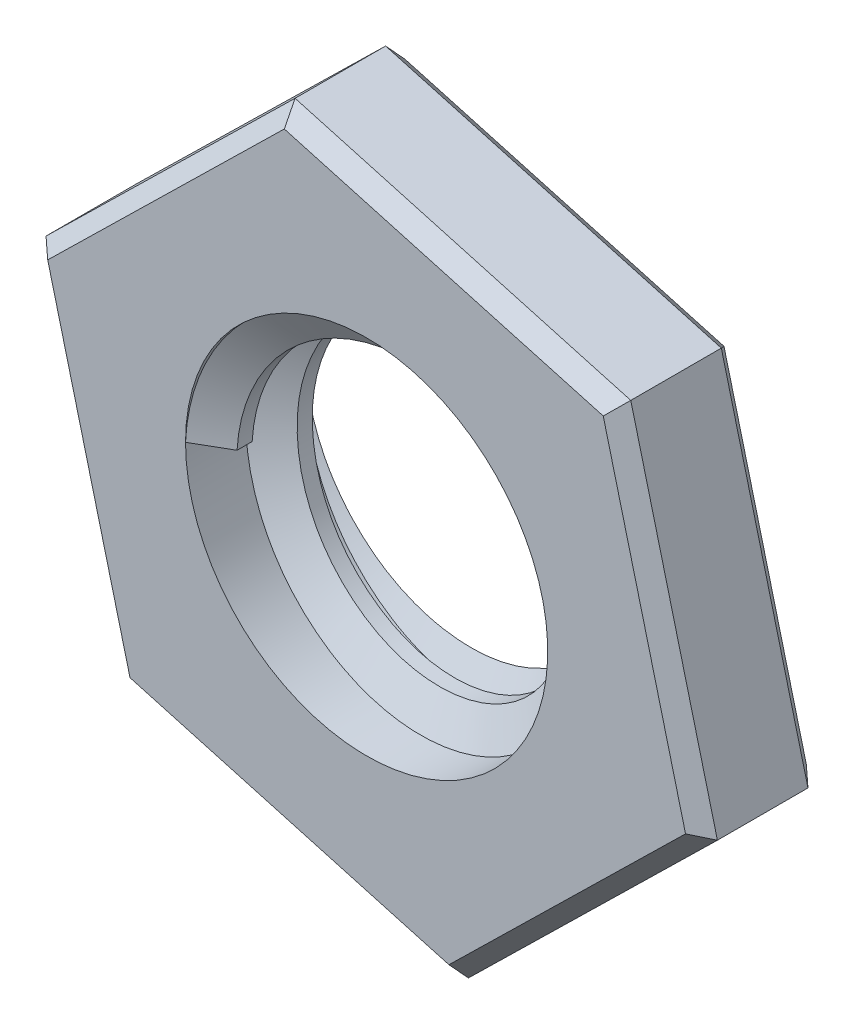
ISO-10303-21;
HEADER;
FILE_DESCRIPTION(('STEP AP214'),'2;1');
FILE_NAME('part.step','',(''),(''),'','','');
FILE_SCHEMA(('AUTOMOTIVE_DESIGN { 1 0 10303 214 1 1 1 1 }'));
ENDSEC;
DATA;
#1=APPLICATION_CONTEXT('core data for automotive mechanical design processes');
#2=APPLICATION_PROTOCOL_DEFINITION('international standard','automotive_design',2000,#1);
#3=PRODUCT_CONTEXT('',#1,'mechanical');
#4=PRODUCT('Part','Part','',(#3));
#5=PRODUCT_RELATED_PRODUCT_CATEGORY('part','',(#4));
#6=PRODUCT_DEFINITION_FORMATION('','',#4);
#7=PRODUCT_DEFINITION_CONTEXT('part definition',#1,'design');
#8=PRODUCT_DEFINITION('design','',#6,#7);
#9=PRODUCT_DEFINITION_SHAPE('','',#8);
#10=(LENGTH_UNIT() NAMED_UNIT(*) SI_UNIT(.MILLI.,.METRE.));
#11=(NAMED_UNIT(*) PLANE_ANGLE_UNIT() SI_UNIT($,.RADIAN.));
#12=(NAMED_UNIT(*) SI_UNIT($,.STERADIAN.) SOLID_ANGLE_UNIT());
#13=UNCERTAINTY_MEASURE_WITH_UNIT(LENGTH_MEASURE(1.E-05),#10,'distance_accuracy_value','');
#14=(GEOMETRIC_REPRESENTATION_CONTEXT(3) GLOBAL_UNCERTAINTY_ASSIGNED_CONTEXT((#13)) GLOBAL_UNIT_ASSIGNED_CONTEXT((#10,
#11,#12)) REPRESENTATION_CONTEXT('',''));
#15=CARTESIAN_POINT('',(0.,0.,0.));
#16=DIRECTION('',(0.,0.,1.));
#17=DIRECTION('',(1.,0.,0.));
#18=AXIS2_PLACEMENT_3D('',#15,#16,#17);
#19=CARTESIAN_POINT('',(47.6495620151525,-46.0306118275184,2.));
#20=DIRECTION('',(0.,0.,-1.));
#21=DIRECTION('',(-1.,0.,0.));
#22=AXIS2_PLACEMENT_3D('',#19,#20,#21);
#23=CYLINDRICAL_SURFACE('',#22,3.);
#24=CARTESIAN_POINT('',(47.6495620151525,-46.0306118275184,0.));
#25=DIRECTION('',(0.,0.,1.));
#26=DIRECTION('',(1.,0.,0.));
#27=AXIS2_PLACEMENT_3D('',#24,#25,#26);
#28=CIRCLE('',#27,3.);
#29=CARTESIAN_POINT('',(45.5282417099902,-43.9092914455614,0.));
#30=VERTEX_POINT('',#29);
#31=CARTESIAN_POINT('',(44.6495620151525,-46.0306118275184,0.));
#32=VERTEX_POINT('',#31);
#33=EDGE_CURVE('E172',#30,#32,#28,.T.);
#34=ORIENTED_EDGE('',*,*,#33,.F.);
#35=CARTESIAN_POINT('',(44.6495620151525,-46.0306118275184,1.12500000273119));
#36=CARTESIAN_POINT('',(44.6495620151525,-44.7879711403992,1.06250000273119));
#37=CARTESIAN_POINT('',(45.5282416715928,-43.9092914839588,1.00000000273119));
#38=CARTESIAN_POINT('',(46.4069213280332,-43.0306118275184,0.937500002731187));
#39=CARTESIAN_POINT('',(47.6495620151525,-43.0306118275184,0.875000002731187));
#40=CARTESIAN_POINT('',(48.8922027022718,-43.0306118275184,0.812500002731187));
#41=CARTESIAN_POINT('',(49.7708823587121,-43.9092914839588,0.750000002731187));
#42=CARTESIAN_POINT('',(50.6495620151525,-44.7879711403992,0.687500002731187));
#43=CARTESIAN_POINT('',(50.6495620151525,-46.0306118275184,0.625000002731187));
#44=CARTESIAN_POINT('',(50.6495620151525,-47.2732525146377,0.562500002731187));
#45=CARTESIAN_POINT('',(49.7708823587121,-48.1519321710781,0.500000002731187));
#46=CARTESIAN_POINT('',(48.8922027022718,-49.0306118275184,0.437500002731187));
#47=CARTESIAN_POINT('',(47.6495620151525,-49.0306118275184,0.375000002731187));
#48=CARTESIAN_POINT('',(46.4069213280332,-49.0306118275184,0.312500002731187));
#49=CARTESIAN_POINT('',(45.5282416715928,-48.1519321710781,0.250000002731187));
#50=CARTESIAN_POINT('',(44.6495620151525,-47.2732525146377,0.187500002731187));
#51=CARTESIAN_POINT('',(44.6495620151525,-46.0306118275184,0.125000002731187));
#52=CARTESIAN_POINT('',(44.6495620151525,-44.7879711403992,0.0625000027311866));
#53=CARTESIAN_POINT('',(45.5282416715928,-43.9092914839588,2.73118658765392E-09));
#54=CARTESIAN_POINT('',(46.4069213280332,-43.0306118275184,-0.0624999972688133));
#55=CARTESIAN_POINT('',(47.6495620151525,-43.0306118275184,-0.124999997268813));
#56=CARTESIAN_POINT('',(48.8922027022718,-43.0306118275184,-0.187499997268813));
#57=CARTESIAN_POINT('',(49.7708823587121,-43.9092914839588,-0.249999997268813));
#58=CARTESIAN_POINT('',(50.6495620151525,-44.7879711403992,-0.312499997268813));
#59=CARTESIAN_POINT('',(50.6495620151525,-46.0306118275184,-0.374999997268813));
#60=CARTESIAN_POINT('',(50.6495620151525,-47.2732525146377,-0.437499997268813));
#61=CARTESIAN_POINT('',(49.7708823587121,-48.1519321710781,-0.499999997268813));
#62=CARTESIAN_POINT('',(48.8922027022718,-49.0306118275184,-0.562499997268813));
#63=CARTESIAN_POINT('',(47.6495620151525,-49.0306118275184,-0.624999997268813));
#64=CARTESIAN_POINT('',(46.4069213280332,-49.0306118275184,-0.687499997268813));
#65=CARTESIAN_POINT('',(45.5282416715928,-48.1519321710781,-0.749999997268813));
#66=CARTESIAN_POINT('',(44.6495620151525,-47.2732525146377,-0.812499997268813));
#67=CARTESIAN_POINT('',(44.6495620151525,-46.0306118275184,-0.874999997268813));
#68=(BOUNDED_CURVE() B_SPLINE_CURVE(2,(#35,#36,#37,#38,#39,#40,#41,#42,#43,#44,#45,#46,#47,#48,
#49,#50,#51,#52,#53,#54,#55,#56,#57,#58,#59,#60,#61,#62,#63,#64,#65,#66,#67),.UNSPECIFIED.,.F.,
.F.) B_SPLINE_CURVE_WITH_KNOTS((3,2,2,2,2,2,2,2,2,2,2,2,2,2,2,2,3),(0.,0.0625,0.125,0.1875,0.25,
0.3125,0.375,0.4375,0.5,0.5625,0.625,0.6875,0.75,0.8125,0.875,0.9375,1.),
.UNSPECIFIED.) CURVE() GEOMETRIC_REPRESENTATION_ITEM() RATIONAL_B_SPLINE_CURVE((1.,
0.923879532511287,1.,0.923879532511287,1.,0.923879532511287,1.,0.923879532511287,1.,
0.923879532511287,1.,0.923879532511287,1.,0.923879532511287,1.,0.923879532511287,1.,
0.923879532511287,1.,0.923879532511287,1.,0.923879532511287,1.,0.923879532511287,1.,
0.923879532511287,1.,0.923879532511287,1.,0.923879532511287,1.,0.923879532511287,1.)) REPRESENTATION_ITEM(''));
#69=CARTESIAN_POINT('',(44.6495620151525,-46.0306118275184,1.12500000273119));
#70=VERTEX_POINT('',#69);
#71=EDGE_CURVE('E52',#70,#30,#68,.T.);
#72=ORIENTED_EDGE('',*,*,#71,.F.);
#73=DIRECTION('',(0.,0.,-1.));
#74=VECTOR('',#73,1.);
#75=CARTESIAN_POINT('',(44.6495620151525,-46.0306118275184,1.56250000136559));
#76=LINE('',#75,#74);
#77=CARTESIAN_POINT('',(44.6495620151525,-46.0306118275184,2.));
#78=VERTEX_POINT('',#77);
#79=EDGE_CURVE('E154',#78,#70,#76,.T.);
#80=ORIENTED_EDGE('',*,*,#79,.F.);
#81=CARTESIAN_POINT('',(47.6495620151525,-46.0306118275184,2.));
#82=DIRECTION('',(0.,0.,1.));
#83=DIRECTION('',(1.,0.,0.));
#84=AXIS2_PLACEMENT_3D('',#81,#82,#83);
#85=CIRCLE('',#84,3.);
#86=EDGE_CURVE('E217',#78,#78,#85,.T.);
#87=ORIENTED_EDGE('',*,*,#86,.T.);
#88=CARTESIAN_POINT('',(44.6495620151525,-46.0306118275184,2.));
#89=CARTESIAN_POINT('',(44.6495620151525,-44.7879711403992,1.9375));
#90=CARTESIAN_POINT('',(45.5282416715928,-43.9092914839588,1.875));
#91=CARTESIAN_POINT('',(46.4069213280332,-43.0306118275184,1.8125));
#92=CARTESIAN_POINT('',(47.6495620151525,-43.0306118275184,1.75));
#93=CARTESIAN_POINT('',(48.8922027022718,-43.0306118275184,1.6875));
#94=CARTESIAN_POINT('',(49.7708823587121,-43.9092914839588,1.625));
#95=CARTESIAN_POINT('',(50.6495620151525,-44.7879711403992,1.5625));
#96=CARTESIAN_POINT('',(50.6495620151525,-46.0306118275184,1.5));
#97=CARTESIAN_POINT('',(50.6495620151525,-47.2732525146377,1.4375));
#98=CARTESIAN_POINT('',(49.7708823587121,-48.1519321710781,1.375));
#99=CARTESIAN_POINT('',(48.8922027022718,-49.0306118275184,1.3125));
#100=CARTESIAN_POINT('',(47.6495620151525,-49.0306118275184,1.25));
#101=CARTESIAN_POINT('',(46.4069213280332,-49.0306118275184,1.1875));
#102=CARTESIAN_POINT('',(45.5282416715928,-48.1519321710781,1.125));
#103=CARTESIAN_POINT('',(44.6495620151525,-47.2732525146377,1.0625));
#104=CARTESIAN_POINT('',(44.6495620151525,-46.0306118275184,1.));
#105=CARTESIAN_POINT('',(44.6495620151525,-44.7879711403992,0.9375));
#106=CARTESIAN_POINT('',(45.5282416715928,-43.9092914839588,0.875));
#107=CARTESIAN_POINT('',(46.4069213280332,-43.0306118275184,0.8125));
#108=CARTESIAN_POINT('',(47.6495620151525,-43.0306118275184,0.75));
#109=CARTESIAN_POINT('',(48.8922027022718,-43.0306118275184,0.6875));
#110=CARTESIAN_POINT('',(49.7708823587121,-43.9092914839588,0.625));
#111=CARTESIAN_POINT('',(50.6495620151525,-44.7879711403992,0.5625));
#112=CARTESIAN_POINT('',(50.6495620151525,-46.0306118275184,0.5));
#113=CARTESIAN_POINT('',(50.6495620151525,-47.2732525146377,0.4375));
#114=CARTESIAN_POINT('',(49.7708823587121,-48.1519321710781,0.375));
#115=CARTESIAN_POINT('',(48.8922027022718,-49.0306118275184,0.3125));
#116=CARTESIAN_POINT('',(47.6495620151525,-49.0306118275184,0.25));
#117=CARTESIAN_POINT('',(46.4069213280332,-49.0306118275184,0.1875));
#118=CARTESIAN_POINT('',(45.5282416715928,-48.1519321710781,0.125));
#119=CARTESIAN_POINT('',(44.6495620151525,-47.2732525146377,0.0625000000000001));
#120=CARTESIAN_POINT('',(44.6495620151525,-46.0306118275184,0.));
#121=(BOUNDED_CURVE() B_SPLINE_CURVE(2,(#88,#89,#90,#91,#92,#93,#94,#95,#96,#97,#98,#99,#100,
#101,#102,#103,#104,#105,#106,#107,#108,#109,#110,#111,#112,#113,#114,#115,#116,#117,#118,#119,
#120),.UNSPECIFIED.,.F.,.F.) B_SPLINE_CURVE_WITH_KNOTS((3,2,2,2,2,2,2,2,2,2,2,2,2,2,2,2,3),(0.,
0.0625,0.125,0.1875,0.25,0.3125,0.375,0.4375,0.5,0.5625,0.625,0.6875,0.75,0.8125,0.875,0.9375,
1.),.UNSPECIFIED.) CURVE() GEOMETRIC_REPRESENTATION_ITEM() RATIONAL_B_SPLINE_CURVE((1.,
0.923879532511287,1.,0.923879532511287,1.,0.923879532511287,1.,0.923879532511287,1.,
0.923879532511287,1.,0.923879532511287,1.,0.923879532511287,1.,0.923879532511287,1.,
0.923879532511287,1.,0.923879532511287,1.,0.923879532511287,1.,0.923879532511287,1.,
0.923879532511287,1.,0.923879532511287,1.,0.923879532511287,1.,0.923879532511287,1.)) REPRESENTATION_ITEM(''));
#122=EDGE_CURVE('E167',#78,#32,#121,.T.);
#123=ORIENTED_EDGE('',*,*,#122,.T.);
#124=EDGE_LOOP('',(#34,#72,#80,#87,#123));
#125=FACE_BOUND('',#124,.T.);
#126=ADVANCED_FACE('F35',(#125),#23,.F.);
#127=CARTESIAN_POINT('',(0.,0.,2.));
#128=DIRECTION('',(0.,0.,1.));
#129=DIRECTION('',(1.,0.,0.));
#130=AXIS2_PLACEMENT_3D('',#127,#128,#129);
#131=PLANE('',#130);
#132=DIRECTION('',(-0.963132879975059,0.269026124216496,0.));
#133=VECTOR('',#132,1.);
#134=CARTESIAN_POINT('',(46.1471109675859,-40.6791191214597,2.));
#135=LINE('',#134,#133);
#136=CARTESIAN_POINT('',(51.568744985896,-42.1935115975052,2.));
#137=VERTEX_POINT('',#136);
#138=CARTESIAN_POINT('',(46.2861272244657,-40.7179496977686,2.));
#139=VERTEX_POINT('',#138);
#140=EDGE_CURVE('E278',#137,#139,#135,.T.);
#141=ORIENTED_EDGE('',*,*,#140,.T.);
#142=DIRECTION('',(-0.714549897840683,-0.699584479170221,0.));
#143=VECTOR('',#142,1.);
#144=CARTESIAN_POINT('',(42.2638078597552,-44.6560262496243,2.));
#145=LINE('',#144,#143);
#146=CARTESIAN_POINT('',(42.3669442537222,-44.5550499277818,2.));
#147=VERTEX_POINT('',#146);
#148=EDGE_CURVE('E11',#139,#147,#145,.T.);
#149=ORIENTED_EDGE('',*,*,#148,.T.);
#150=DIRECTION('',(0.248582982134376,-0.968610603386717,0.));
#151=VECTOR('',#150,1.);
#152=CARTESIAN_POINT('',(43.7662589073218,-50.007518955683,2.));
#153=LINE('',#152,#151);
#154=CARTESIAN_POINT('',(43.730379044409,-49.8677120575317,2.));
#155=VERTEX_POINT('',#154);
#156=EDGE_CURVE('E44',#147,#155,#153,.T.);
#157=ORIENTED_EDGE('',*,*,#156,.T.);
#158=DIRECTION('',(0.963132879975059,-0.269026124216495,0.));
#159=VECTOR('',#158,1.);
#160=CARTESIAN_POINT('',(49.152013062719,-51.3821045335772,2.));
#161=LINE('',#160,#159);
#162=CARTESIAN_POINT('',(49.0129968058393,-51.3432739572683,2.));
#163=VERTEX_POINT('',#162);
#164=EDGE_CURVE('E284',#155,#163,#161,.T.);
#165=ORIENTED_EDGE('',*,*,#164,.T.);
#166=DIRECTION('',(0.714549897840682,0.699584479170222,0.));
#167=VECTOR('',#166,1.);
#168=CARTESIAN_POINT('',(53.0353161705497,-47.4051974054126,2.));
#169=LINE('',#168,#167);
#170=CARTESIAN_POINT('',(52.9321797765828,-47.5061737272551,2.));
#171=VERTEX_POINT('',#170);
#172=EDGE_CURVE('E282',#163,#171,#169,.T.);
#173=ORIENTED_EDGE('',*,*,#172,.T.);
#174=DIRECTION('',(-0.248582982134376,0.968610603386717,0.));
#175=VECTOR('',#174,1.);
#176=CARTESIAN_POINT('',(51.5328651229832,-42.0537046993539,2.));
#177=LINE('',#176,#175);
#178=EDGE_CURVE('E280',#171,#137,#177,.T.);
#179=ORIENTED_EDGE('',*,*,#178,.T.);
#180=EDGE_LOOP('',(#141,#149,#157,#165,#173,#179));
#181=FACE_BOUND('',#180,.T.);
#182=ORIENTED_EDGE('',*,*,#86,.F.);
#183=EDGE_LOOP('',(#182));
#184=FACE_BOUND('',#183,.T.);
#185=ADVANCED_FACE('F386',(#181,#184),#131,.T.);
#186=CARTESIAN_POINT('',(0.,0.,0.));
#187=DIRECTION('',(0.,0.,1.));
#188=DIRECTION('',(1.,0.,0.));
#189=AXIS2_PLACEMENT_3D('',#186,#187,#188);
#190=PLANE('',#189);
#191=DIRECTION('',(-0.248582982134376,0.968610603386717,0.));
#192=VECTOR('',#191,1.);
#193=CARTESIAN_POINT('',(29.0209726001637,7.44790516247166,0.));
#194=LINE('',#193,#192);
#195=CARTESIAN_POINT('',(43.730379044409,-49.8677120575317,0.));
#196=VERTEX_POINT('',#195);
#197=CARTESIAN_POINT('',(42.3669442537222,-44.5550499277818,0.));
#198=VERTEX_POINT('',#197);
#199=EDGE_CURVE('E253',#196,#198,#194,.T.);
#200=ORIENTED_EDGE('',*,*,#199,.T.);
#201=DIRECTION('',(0.714549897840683,0.699584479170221,0.));
#202=VECTOR('',#201,1.);
#203=CARTESIAN_POINT('',(43.007699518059,-43.9277145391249,0.));
#204=LINE('',#203,#202);
#205=CARTESIAN_POINT('',(46.2861272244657,-40.7179496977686,0.));
#206=VERTEX_POINT('',#205);
#207=EDGE_CURVE('E255',#198,#206,#204,.T.);
#208=ORIENTED_EDGE('',*,*,#207,.T.);
#209=DIRECTION('',(0.963132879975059,-0.269026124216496,0.));
#210=VECTOR('',#209,1.);
#211=CARTESIAN_POINT('',(-7.20038164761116,-25.777884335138,0.));
#212=LINE('',#211,#210);
#213=CARTESIAN_POINT('',(51.568744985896,-42.1935115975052,0.));
#214=VERTEX_POINT('',#213);
#215=EDGE_CURVE('E245',#206,#214,#212,.T.);
#216=ORIENTED_EDGE('',*,*,#215,.T.);
#217=DIRECTION('',(0.248582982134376,-0.968610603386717,0.));
#218=VECTOR('',#217,1.);
#219=CARTESIAN_POINT('',(38.2227733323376,9.80944349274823,0.));
#220=LINE('',#219,#218);
#221=CARTESIAN_POINT('',(52.9321797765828,-47.5061737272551,0.));
#222=VERTEX_POINT('',#221);
#223=EDGE_CURVE('E247',#214,#222,#220,.T.);
#224=ORIENTED_EDGE('',*,*,#223,.T.);
#225=DIRECTION('',(-0.714549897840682,-0.699584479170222,0.));
#226=VECTOR('',#225,1.);
#227=CARTESIAN_POINT('',(49.6537520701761,-50.7159385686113,0.));
#228=LINE('',#227,#226);
#229=CARTESIAN_POINT('',(49.0129968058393,-51.3432739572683,0.));
#230=VERTEX_POINT('',#229);
#231=EDGE_CURVE('E249',#222,#230,#228,.T.);
#232=ORIENTED_EDGE('',*,*,#231,.T.);
#233=DIRECTION('',(-0.963132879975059,0.269026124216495,0.));
#234=VECTOR('',#233,1.);
#235=CARTESIAN_POINT('',(-9.75612982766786,-34.9276466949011,0.));
#236=LINE('',#235,#234);
#237=EDGE_CURVE('E251',#230,#196,#236,.T.);
#238=ORIENTED_EDGE('',*,*,#237,.T.);
#239=EDGE_LOOP('',(#200,#208,#216,#224,#232,#238));
#240=FACE_BOUND('',#239,.T.);
#241=ORIENTED_EDGE('',*,*,#33,.T.);
#242=CARTESIAN_POINT('',(48.590478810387,-48.3021859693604,0.));
#243=CARTESIAN_POINT('',(48.5302760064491,-48.3356530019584,0.));
#244=CARTESIAN_POINT('',(48.4686508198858,-48.366559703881,0.));
#245=CARTESIAN_POINT('',(48.3430091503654,-48.4230674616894,0.));
#246=CARTESIAN_POINT('',(48.2789925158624,-48.4486681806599,0.));
#247=CARTESIAN_POINT('',(48.1492712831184,-48.494289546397,0.));
#248=CARTESIAN_POINT('',(48.0835738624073,-48.5143306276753,0.));
#249=CARTESIAN_POINT('',(47.9507328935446,-48.548817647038,0.));
#250=CARTESIAN_POINT('',(47.8835896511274,-48.5632647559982,0.));
#251=CARTESIAN_POINT('',(47.7821758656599,-48.5806777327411,0.));
#252=CARTESIAN_POINT('',(47.7482584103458,-48.5857721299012,0.));
#253=CARTESIAN_POINT('',(47.6802458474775,-48.5945158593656,0.));
#254=CARTESIAN_POINT('',(47.6461507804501,-48.5981655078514,0.));
#255=CARTESIAN_POINT('',(47.5436789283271,-48.6071349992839,0.));
#256=CARTESIAN_POINT('',(47.4751200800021,-48.6104746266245,0.));
#257=CARTESIAN_POINT('',(47.3378722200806,-48.6118497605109,0.));
#258=CARTESIAN_POINT('',(47.2691831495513,-48.6098791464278,0.));
#259=CARTESIAN_POINT('',(47.132183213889,-48.6006372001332,0.));
#260=CARTESIAN_POINT('',(47.0638723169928,-48.5933663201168,0.));
#261=CARTESIAN_POINT('',(46.8505499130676,-48.5622511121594,0.));
#262=CARTESIAN_POINT('',(46.70680392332,-48.5289622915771,0.));
#263=CARTESIAN_POINT('',(46.4268770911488,-48.4391261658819,0.));
#264=CARTESIAN_POINT('',(46.2906916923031,-48.3825930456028,0.));
#265=CARTESIAN_POINT('',(46.0937378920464,-48.2810368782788,0.));
#266=CARTESIAN_POINT('',(46.0287534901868,-48.2439778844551,0.));
#267=CARTESIAN_POINT('',(45.9021038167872,-48.1645360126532,0.));
#268=CARTESIAN_POINT('',(45.8404383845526,-48.122153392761,0.));
#269=CARTESIAN_POINT('',(45.7208972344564,-48.0322969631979,0.));
#270=CARTESIAN_POINT('',(45.6630236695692,-47.9848203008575,0.));
#271=CARTESIAN_POINT('',(45.5511286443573,-47.8855239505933,0.));
#272=CARTESIAN_POINT('',(45.4971077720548,-47.8337036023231,0.));
#273=CARTESIAN_POINT('',(45.3918511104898,-47.7245353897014,0.));
#274=CARTESIAN_POINT('',(45.3407310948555,-47.6670754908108,0.));
#275=CARTESIAN_POINT('',(45.2432667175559,-47.5482821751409,0.));
#276=CARTESIAN_POINT('',(45.1969218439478,-47.4869491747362,0.));
#277=CARTESIAN_POINT('',(45.0654886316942,-47.2976539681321,0.));
#278=CARTESIAN_POINT('',(44.9879121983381,-47.1643026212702,0.));
#279=CARTESIAN_POINT('',(44.884203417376,-46.94789108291,0.));
#280=CARTESIAN_POINT('',(44.8504160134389,-46.8683653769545,0.));
#281=CARTESIAN_POINT('',(44.7901003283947,-46.7065661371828,0.));
#282=CARTESIAN_POINT('',(44.7635728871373,-46.6242922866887,0.));
#283=CARTESIAN_POINT('',(44.7179710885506,-46.4575283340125,0.));
#284=CARTESIAN_POINT('',(44.6989123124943,-46.3730339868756,0.));
#285=CARTESIAN_POINT('',(44.6684576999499,-46.2026782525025,0.));
#286=CARTESIAN_POINT('',(44.6570616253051,-46.1168169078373,0.));
#287=CARTESIAN_POINT('',(44.6495620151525,-46.0306118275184,0.));
#288=B_SPLINE_CURVE_WITH_KNOTS('',3,(#242,#243,#244,#245,#246,#247,#248,#249,#250,#251,#252,
#253,#254,#255,#256,#257,#258,#259,#260,#261,#262,#263,#264,#265,#266,#267,#268,#269,#270,#271,
#272,#273,#274,#275,#276,#277,#278,#279,#280,#281,#282,#283,#284,#285,#286,#287),.UNSPECIFIED.,
.F.,.F.,(4,2,2,2,2,2,2,2,2,2,2,2,2,2,2,2,2,2,2,2,2,2,4),(0.,0.206577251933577,0.413167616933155,
0.618988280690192,0.824765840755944,0.927632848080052,1.03047733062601,1.23618020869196,
1.44212028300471,1.64804278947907,2.08852760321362,2.52874400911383,2.75294988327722,
2.97714489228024,3.20146611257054,3.42582149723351,3.65628140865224,3.88671658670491,
4.34720407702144,4.60614103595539,4.86510793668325,5.12461225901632,5.38410851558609),.UNSPECIFIED.);
#289=CARTESIAN_POINT('',(48.590478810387,-48.3021859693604,0.));
#290=VERTEX_POINT('',#289);
#291=EDGE_CURVE('E178',#290,#32,#288,.T.);
#292=ORIENTED_EDGE('',*,*,#291,.F.);
#293=CARTESIAN_POINT('',(49.9211361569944,-45.0896950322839,0.));
#294=CARTESIAN_POINT('',(49.9532407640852,-45.167186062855,0.));
#295=CARTESIAN_POINT('',(49.9813518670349,-45.2462891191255,0.));
#296=CARTESIAN_POINT('',(50.029399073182,-45.407075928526,0.));
#297=CARTESIAN_POINT('',(50.0493222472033,-45.4887635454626,0.));
#298=CARTESIAN_POINT('',(50.0908127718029,-45.7070041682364,0.));
#299=CARTESIAN_POINT('',(50.1051685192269,-45.844995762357,0.));
#300=CARTESIAN_POINT('',(50.1105107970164,-46.1214747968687,0.));
#301=CARTESIAN_POINT('',(50.1014806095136,-46.2599625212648,0.));
#302=CARTESIAN_POINT('',(50.0602983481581,-46.5334366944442,0.));
#303=CARTESIAN_POINT('',(50.0281516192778,-46.668423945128,0.));
#304=CARTESIAN_POINT('',(49.9416554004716,-46.9310501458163,0.));
#305=CARTESIAN_POINT('',(49.8873115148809,-47.058690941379,0.));
#306=CARTESIAN_POINT('',(49.7579851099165,-47.3030278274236,0.));
#307=CARTESIAN_POINT('',(49.6830027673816,-47.419724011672,0.));
#308=CARTESIAN_POINT('',(49.5144309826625,-47.6389444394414,0.));
#309=CARTESIAN_POINT('',(49.4208365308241,-47.7414648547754,0.));
#310=CARTESIAN_POINT('',(49.2662079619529,-47.8845546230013,0.));
#311=CARTESIAN_POINT('',(49.2108510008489,-47.9314031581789,0.));
#312=CARTESIAN_POINT('',(49.0962002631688,-48.020047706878,0.));
#313=CARTESIAN_POINT('',(49.0369062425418,-48.0618434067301,0.));
#314=CARTESIAN_POINT('',(48.9147861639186,-48.1400776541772,0.));
#315=CARTESIAN_POINT('',(48.8519558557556,-48.1765095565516,0.));
#316=CARTESIAN_POINT('',(48.7233228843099,-48.243683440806,0.));
#317=CARTESIAN_POINT('',(48.6575201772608,-48.2744253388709,0.));
#318=CARTESIAN_POINT('',(48.590478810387,-48.3021859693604,0.));
#319=B_SPLINE_CURVE_WITH_KNOTS('',3,(#293,#294,#295,#296,#297,#298,#299,#300,#301,#302,#303,
#304,#305,#306,#307,#308,#309,#310,#311,#312,#313,#314,#315,#316,#317,#318),.UNSPECIFIED.,.F.,
.F.,(4,2,2,2,2,2,2,2,2,2,2,2,4),(0.,0.251448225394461,0.503291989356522,0.91740276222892,
1.33180965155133,1.7461207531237,2.16032731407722,2.57453032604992,2.98884497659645,
3.20616867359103,3.42350585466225,3.64111006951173,3.85871748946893),.UNSPECIFIED.);
#320=CARTESIAN_POINT('',(49.9211361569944,-45.0896950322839,0.));
#321=VERTEX_POINT('',#320);
#322=EDGE_CURVE('E415',#321,#290,#319,.T.);
#323=ORIENTED_EDGE('',*,*,#322,.F.);
#324=CARTESIAN_POINT('',(45.5282417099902,-43.9092914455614,0.));
#325=CARTESIAN_POINT('',(45.5903497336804,-43.8571258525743,0.));
#326=CARTESIAN_POINT('',(45.6546669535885,-43.8075922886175,0.));
#327=CARTESIAN_POINT('',(45.7872381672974,-43.714117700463,0.));
#328=CARTESIAN_POINT('',(45.8554918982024,-43.6701763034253,0.));
#329=CARTESIAN_POINT('',(45.9953862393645,-43.5882523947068,0.));
#330=CARTESIAN_POINT('',(46.0670230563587,-43.5502634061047,0.));
#331=CARTESIAN_POINT('',(46.2132441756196,-43.480457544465,0.));
#332=CARTESIAN_POINT('',(46.2878285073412,-43.4486407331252,0.));
#333=CARTESIAN_POINT('',(46.4394181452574,-43.3914084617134,0.));
#334=CARTESIAN_POINT('',(46.5164235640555,-43.3659932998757,0.));
#335=CARTESIAN_POINT('',(46.6723035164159,-43.3217485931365,0.));
#336=CARTESIAN_POINT('',(46.7511780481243,-43.3029190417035,0.));
#337=CARTESIAN_POINT('',(46.9102578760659,-43.2719776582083,0.));
#338=CARTESIAN_POINT('',(46.9904635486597,-43.2598677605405,0.));
#339=CARTESIAN_POINT('',(47.1516231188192,-43.242451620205,0.));
#340=CARTESIAN_POINT('',(47.2325771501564,-43.237146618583,0.));
#341=CARTESIAN_POINT('',(47.3946921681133,-43.2334027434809,0.));
#342=CARTESIAN_POINT('',(47.4758532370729,-43.2349672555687,0.));
#343=CARTESIAN_POINT('',(47.5972502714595,-43.2423910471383,0.));
#344=CARTESIAN_POINT('',(47.6376556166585,-43.2457113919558,0.));
#345=CARTESIAN_POINT('',(47.7182757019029,-43.2541652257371,0.));
#346=CARTESIAN_POINT('',(47.7584904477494,-43.2592986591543,0.));
#347=CARTESIAN_POINT('',(47.8786273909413,-43.2774349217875,0.));
#348=CARTESIAN_POINT('',(47.9581556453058,-43.2931803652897,0.));
#349=CARTESIAN_POINT('',(48.115506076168,-43.3318482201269,0.));
#350=CARTESIAN_POINT('',(48.193326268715,-43.3547785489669,0.));
#351=CARTESIAN_POINT('',(48.4155853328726,-43.4314805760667,0.));
#352=CARTESIAN_POINT('',(48.5569684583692,-43.4944390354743,0.));
#353=CARTESIAN_POINT('',(48.8266770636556,-43.6438843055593,0.));
#354=CARTESIAN_POINT('',(48.9550044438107,-43.7303676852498,0.));
#355=CARTESIAN_POINT('',(49.1331026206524,-43.8743018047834,0.));
#356=CARTESIAN_POINT('',(49.189392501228,-43.9238768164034,0.));
#357=CARTESIAN_POINT('',(49.2975505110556,-44.0275710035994,0.));
#358=CARTESIAN_POINT('',(49.3494223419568,-44.0816862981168,0.));
#359=CARTESIAN_POINT('',(49.4483913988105,-44.1940134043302,0.));
#360=CARTESIAN_POINT('',(49.4954941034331,-44.2522203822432,0.));
#361=CARTESIAN_POINT('',(49.584129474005,-44.3727384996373,0.));
#362=CARTESIAN_POINT('',(49.6256631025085,-44.4350489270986,0.));
#363=CARTESIAN_POINT('',(49.6920245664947,-44.5451944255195,0.));
#364=CARTESIAN_POINT('',(49.7182695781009,-44.5921843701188,0.));
#365=CARTESIAN_POINT('',(49.7676019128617,-44.6877903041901,0.));
#366=CARTESIAN_POINT('',(49.7906896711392,-44.7364060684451,0.));
#367=CARTESIAN_POINT('',(49.8336346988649,-44.8351145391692,0.));
#368=CARTESIAN_POINT('',(49.853487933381,-44.8852089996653,0.));
#369=CARTESIAN_POINT('',(49.8898456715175,-44.9866033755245,0.));
#370=CARTESIAN_POINT('',(49.9063498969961,-45.0379033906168,0.));
#371=CARTESIAN_POINT('',(49.9211361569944,-45.0896950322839,0.));
#372=B_SPLINE_CURVE_WITH_KNOTS('',3,(#324,#325,#326,#327,#328,#329,#330,#331,#332,#333,#334,
#335,#336,#337,#338,#339,#340,#341,#342,#343,#344,#345,#346,#347,#348,#349,#350,#351,#352,#353,
#354,#355,#356,#357,#358,#359,#360,#361,#362,#363,#364,#365,#366,#367,#368,#369,#370,#371),
.UNSPECIFIED.,.F.,.F.,(4,2,2,2,2,2,2,2,2,2,2,2,2,2,2,2,2,2,2,2,2,2,2,4),(0.,0.243253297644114,
0.486490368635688,0.729460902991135,0.972433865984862,1.21541814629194,1.45840218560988,
1.70145613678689,1.94455440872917,2.18777250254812,2.30936399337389,2.43095175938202,
2.67378791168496,2.91689260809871,3.37871936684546,3.84047880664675,4.06528042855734,
4.28989180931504,4.51424216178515,4.73855368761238,4.89991447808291,5.06125300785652,
5.22279128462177,5.38434297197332),.UNSPECIFIED.);
#373=EDGE_CURVE('E215',#30,#321,#372,.T.);
#374=ORIENTED_EDGE('',*,*,#373,.F.);
#375=EDGE_LOOP('',(#241,#292,#323,#374));
#376=FACE_BOUND('',#375,.T.);
#377=ADVANCED_FACE('F347',(#240,#376),#190,.F.);
#378=CARTESIAN_POINT('',(53.2102122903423,-47.5838348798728,2.));
#379=DIRECTION('',(-0.968610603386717,-0.248582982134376,0.));
#380=DIRECTION('',(0.248582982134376,-0.968610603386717,0.));
#381=AXIS2_PLACEMENT_3D('',#378,#379,#380);
#382=PLANE('',#381);
#383=DIRECTION('',(0.,0.,-1.));
#384=VECTOR('',#383,1.);
#385=CARTESIAN_POINT('',(53.2102122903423,-47.5838348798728,2.));
#386=LINE('',#385,#384);
#387=CARTESIAN_POINT('',(53.2102122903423,-47.5838348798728,1.75));
#388=VERTEX_POINT('',#387);
#389=CARTESIAN_POINT('',(53.2102122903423,-47.5838348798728,0.250000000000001));
#390=VERTEX_POINT('',#389);
#391=EDGE_CURVE('E219',#388,#390,#386,.T.);
#392=ORIENTED_EDGE('',*,*,#391,.T.);
#393=DIRECTION('',(-0.248582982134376,0.968610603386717,0.));
#394=VECTOR('',#393,1.);
#395=CARTESIAN_POINT('',(53.2102122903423,-47.5838348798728,0.250000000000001));
#396=LINE('',#395,#394);
#397=CARTESIAN_POINT('',(51.7750177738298,-41.9915589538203,0.25));
#398=VERTEX_POINT('',#397);
#399=EDGE_CURVE('E272',#390,#398,#396,.T.);
#400=ORIENTED_EDGE('',*,*,#399,.T.);
#401=DIRECTION('',(0.,0.,-1.));
#402=VECTOR('',#401,1.);
#403=CARTESIAN_POINT('',(51.7750177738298,-41.9915589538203,2.));
#404=LINE('',#403,#402);
#405=CARTESIAN_POINT('',(51.7750177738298,-41.9915589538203,1.74999999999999));
#406=VERTEX_POINT('',#405);
#407=EDGE_CURVE('E236',#406,#398,#404,.T.);
#408=ORIENTED_EDGE('',*,*,#407,.F.);
#409=DIRECTION('',(0.248582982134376,-0.968610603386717,0.));
#410=VECTOR('',#409,1.);
#411=CARTESIAN_POINT('',(53.2102122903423,-47.5838348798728,1.75));
#412=LINE('',#411,#410);
#413=EDGE_CURVE('E270',#406,#388,#412,.T.);
#414=ORIENTED_EDGE('',*,*,#413,.T.);
#415=EDGE_LOOP('',(#392,#400,#408,#414));
#416=FACE_BOUND('',#415,.T.);
#417=ADVANCED_FACE('F367',(#416),#382,.F.);
#418=CARTESIAN_POINT('',(51.7750177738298,-41.9915589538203,2.));
#419=DIRECTION('',(-0.269026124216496,-0.963132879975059,0.));
#420=DIRECTION('',(0.963132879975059,-0.269026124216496,0.));
#421=AXIS2_PLACEMENT_3D('',#418,#419,#420);
#422=PLANE('',#421);
#423=ORIENTED_EDGE('',*,*,#407,.T.);
#424=DIRECTION('',(-0.963132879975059,0.269026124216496,0.));
#425=VECTOR('',#424,1.);
#426=CARTESIAN_POINT('',(51.7750177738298,-41.9915589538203,0.25));
#427=LINE('',#426,#425);
#428=CARTESIAN_POINT('',(46.2143674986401,-40.438335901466,0.25));
#429=VERTEX_POINT('',#428);
#430=EDGE_CURVE('E276',#398,#429,#427,.T.);
#431=ORIENTED_EDGE('',*,*,#430,.T.);
#432=DIRECTION('',(0.,0.,-1.));
#433=VECTOR('',#432,1.);
#434=CARTESIAN_POINT('',(46.2143674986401,-40.438335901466,2.));
#435=LINE('',#434,#433);
#436=CARTESIAN_POINT('',(46.2143674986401,-40.438335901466,1.74999999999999));
#437=VERTEX_POINT('',#436);
#438=EDGE_CURVE('E233',#437,#429,#435,.T.);
#439=ORIENTED_EDGE('',*,*,#438,.F.);
#440=DIRECTION('',(0.963132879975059,-0.269026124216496,0.));
#441=VECTOR('',#440,1.);
#442=CARTESIAN_POINT('',(51.7750177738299,-41.9915589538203,1.74999999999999));
#443=LINE('',#442,#441);
#444=EDGE_CURVE('E274',#437,#406,#443,.T.);
#445=ORIENTED_EDGE('',*,*,#444,.T.);
#446=EDGE_LOOP('',(#423,#431,#439,#445));
#447=FACE_BOUND('',#446,.T.);
#448=ADVANCED_FACE('F370',(#447),#422,.F.);
#449=CARTESIAN_POINT('',(46.2143674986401,-40.438335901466,2.));
#450=DIRECTION('',(0.699584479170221,-0.714549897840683,0.));
#451=DIRECTION('',(0.714549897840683,0.699584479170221,0.));
#452=AXIS2_PLACEMENT_3D('',#449,#450,#451);
#453=PLANE('',#452);
#454=ORIENTED_EDGE('',*,*,#438,.T.);
#455=DIRECTION('',(-0.714549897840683,-0.699584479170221,0.));
#456=VECTOR('',#455,1.);
#457=CARTESIAN_POINT('',(46.2143674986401,-40.438335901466,0.250000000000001));
#458=LINE('',#457,#456);
#459=CARTESIAN_POINT('',(42.0889117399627,-44.4773887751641,0.25));
#460=VERTEX_POINT('',#459);
#461=EDGE_CURVE('E242',#429,#460,#458,.T.);
#462=ORIENTED_EDGE('',*,*,#461,.T.);
#463=DIRECTION('',(0.,0.,-1.));
#464=VECTOR('',#463,1.);
#465=CARTESIAN_POINT('',(42.0889117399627,-44.4773887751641,2.));
#466=LINE('',#465,#464);
#467=CARTESIAN_POINT('',(42.0889117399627,-44.4773887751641,1.75));
#468=VERTEX_POINT('',#467);
#469=EDGE_CURVE('E230',#468,#460,#466,.T.);
#470=ORIENTED_EDGE('',*,*,#469,.F.);
#471=DIRECTION('',(0.714549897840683,0.699584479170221,0.));
#472=VECTOR('',#471,1.);
#473=CARTESIAN_POINT('',(46.2143674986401,-40.438335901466,1.75));
#474=LINE('',#473,#472);
#475=EDGE_CURVE('E239',#468,#437,#474,.T.);
#476=ORIENTED_EDGE('',*,*,#475,.T.);
#477=EDGE_LOOP('',(#454,#462,#470,#476));
#478=FACE_BOUND('',#477,.T.);
#479=ADVANCED_FACE('F379',(#478),#453,.F.);
#480=CARTESIAN_POINT('',(42.0889117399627,-44.4773887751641,2.));
#481=DIRECTION('',(0.968610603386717,0.248582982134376,0.));
#482=DIRECTION('',(-0.248582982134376,0.968610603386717,0.));
#483=AXIS2_PLACEMENT_3D('',#480,#481,#482);
#484=PLANE('',#483);
#485=ORIENTED_EDGE('',*,*,#469,.T.);
#486=DIRECTION('',(0.248582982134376,-0.968610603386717,0.));
#487=VECTOR('',#486,1.);
#488=CARTESIAN_POINT('',(42.0889117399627,-44.4773887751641,0.25));
#489=LINE('',#488,#487);
#490=CARTESIAN_POINT('',(43.5241062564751,-50.0696647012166,0.25));
#491=VERTEX_POINT('',#490);
#492=EDGE_CURVE('E260',#460,#491,#489,.T.);
#493=ORIENTED_EDGE('',*,*,#492,.T.);
#494=DIRECTION('',(0.,0.,-1.));
#495=VECTOR('',#494,1.);
#496=CARTESIAN_POINT('',(43.5241062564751,-50.0696647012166,2.));
#497=LINE('',#496,#495);
#498=CARTESIAN_POINT('',(43.5241062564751,-50.0696647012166,1.75));
#499=VERTEX_POINT('',#498);
#500=EDGE_CURVE('E227',#499,#491,#497,.T.);
#501=ORIENTED_EDGE('',*,*,#500,.F.);
#502=DIRECTION('',(-0.248582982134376,0.968610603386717,0.));
#503=VECTOR('',#502,1.);
#504=CARTESIAN_POINT('',(42.0889117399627,-44.4773887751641,1.75));
#505=LINE('',#504,#503);
#506=EDGE_CURVE('E258',#499,#468,#505,.T.);
#507=ORIENTED_EDGE('',*,*,#506,.T.);
#508=EDGE_LOOP('',(#485,#493,#501,#507));
#509=FACE_BOUND('',#508,.T.);
#510=ADVANCED_FACE('F571',(#509),#484,.F.);
#511=CARTESIAN_POINT('',(43.5241062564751,-50.0696647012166,2.));
#512=DIRECTION('',(0.269026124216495,0.963132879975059,0.));
#513=DIRECTION('',(-0.963132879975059,0.269026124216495,0.));
#514=AXIS2_PLACEMENT_3D('',#511,#512,#513);
#515=PLANE('',#514);
#516=ORIENTED_EDGE('',*,*,#500,.T.);
#517=DIRECTION('',(0.963132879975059,-0.269026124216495,0.));
#518=VECTOR('',#517,1.);
#519=CARTESIAN_POINT('',(43.5241062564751,-50.0696647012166,0.25));
#520=LINE('',#519,#518);
#521=CARTESIAN_POINT('',(49.0847565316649,-51.6228877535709,0.25));
#522=VERTEX_POINT('',#521);
#523=EDGE_CURVE('E264',#491,#522,#520,.T.);
#524=ORIENTED_EDGE('',*,*,#523,.T.);
#525=DIRECTION('',(0.,0.,-1.));
#526=VECTOR('',#525,1.);
#527=CARTESIAN_POINT('',(49.0847565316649,-51.6228877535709,2.));
#528=LINE('',#527,#526);
#529=CARTESIAN_POINT('',(49.0847565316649,-51.6228877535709,1.75));
#530=VERTEX_POINT('',#529);
#531=EDGE_CURVE('E224',#530,#522,#528,.T.);
#532=ORIENTED_EDGE('',*,*,#531,.F.);
#533=DIRECTION('',(-0.963132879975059,0.269026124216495,0.));
#534=VECTOR('',#533,1.);
#535=CARTESIAN_POINT('',(43.5241062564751,-50.0696647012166,1.75));
#536=LINE('',#535,#534);
#537=EDGE_CURVE('E262',#530,#499,#536,.T.);
#538=ORIENTED_EDGE('',*,*,#537,.T.);
#539=EDGE_LOOP('',(#516,#524,#532,#538));
#540=FACE_BOUND('',#539,.T.);
#541=ADVANCED_FACE('F332',(#540),#515,.F.);
#542=CARTESIAN_POINT('',(49.0847565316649,-51.6228877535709,2.));
#543=DIRECTION('',(-0.699584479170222,0.714549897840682,0.));
#544=DIRECTION('',(-0.714549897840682,-0.699584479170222,0.));
#545=AXIS2_PLACEMENT_3D('',#542,#543,#544);
#546=PLANE('',#545);
#547=ORIENTED_EDGE('',*,*,#531,.T.);
#548=DIRECTION('',(0.714549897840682,0.699584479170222,0.));
#549=VECTOR('',#548,1.);
#550=CARTESIAN_POINT('',(49.0847565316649,-51.6228877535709,0.25));
#551=LINE('',#550,#549);
#552=EDGE_CURVE('E268',#522,#390,#551,.T.);
#553=ORIENTED_EDGE('',*,*,#552,.T.);
#554=ORIENTED_EDGE('',*,*,#391,.F.);
#555=DIRECTION('',(-0.714549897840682,-0.699584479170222,0.));
#556=VECTOR('',#555,1.);
#557=CARTESIAN_POINT('',(49.0847565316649,-51.6228877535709,1.75));
#558=LINE('',#557,#556);
#559=EDGE_CURVE('E266',#388,#530,#558,.T.);
#560=ORIENTED_EDGE('',*,*,#559,.T.);
#561=EDGE_LOOP('',(#547,#553,#554,#560));
#562=FACE_BOUND('',#561,.T.);
#563=ADVANCED_FACE('F329',(#562),#546,.F.);
#564=CARTESIAN_POINT('',(49.0847565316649,-51.6228877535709,0.25));
#565=DIRECTION('',(-0.494680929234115,0.505263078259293,0.707106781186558));
#566=DIRECTION('',(0.714549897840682,0.699584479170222,0.));
#567=AXIS2_PLACEMENT_3D('',#564,#565,#566);
#568=PLANE('',#567);
#569=DIRECTION('',(-0.18791107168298,0.732200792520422,-0.65465367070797));
#570=VECTOR('',#569,1.);
#571=CARTESIAN_POINT('',(49.0847565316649,-51.6228877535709,0.25));
#572=LINE('',#571,#570);
#573=EDGE_CURVE('E297',#230,#522,#572,.F.);
#574=ORIENTED_EDGE('',*,*,#573,.F.);
#575=ORIENTED_EDGE('',*,*,#231,.F.);
#576=DIRECTION('',(-0.728060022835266,0.203364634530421,-0.65465367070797));
#577=VECTOR('',#576,1.);
#578=CARTESIAN_POINT('',(53.2102122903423,-47.5838348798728,0.25));
#579=LINE('',#578,#577);
#580=EDGE_CURVE('E221',#390,#222,#579,.T.);
#581=ORIENTED_EDGE('',*,*,#580,.F.);
#582=ORIENTED_EDGE('',*,*,#552,.F.);
#583=EDGE_LOOP('',(#574,#575,#581,#582));
#584=FACE_BOUND('',#583,.T.);
#585=ADVANCED_FACE('F365',(#584),#568,.F.);
#586=CARTESIAN_POINT('',(53.2102122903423,-47.5838348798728,0.25));
#587=DIRECTION('',(-0.684911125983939,-0.175774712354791,0.70710678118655));
#588=DIRECTION('',(-0.248582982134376,0.968610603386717,0.));
#589=AXIS2_PLACEMENT_3D('',#586,#587,#588);
#590=PLANE('',#589);
#591=ORIENTED_EDGE('',*,*,#580,.T.);
#592=ORIENTED_EDGE('',*,*,#223,.F.);
#593=DIRECTION('',(-0.540148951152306,-0.528836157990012,-0.654653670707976));
#594=VECTOR('',#593,1.);
#595=CARTESIAN_POINT('',(51.7750177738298,-41.9915589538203,0.25));
#596=LINE('',#595,#594);
#597=EDGE_CURVE('E294',#398,#214,#596,.T.);
#598=ORIENTED_EDGE('',*,*,#597,.F.);
#599=ORIENTED_EDGE('',*,*,#399,.F.);
#600=EDGE_LOOP('',(#591,#592,#598,#599));
#601=FACE_BOUND('',#600,.T.);
#602=ADVANCED_FACE('F361',(#601),#590,.F.);
#603=CARTESIAN_POINT('',(43.5241062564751,-50.0696647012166,0.25));
#604=DIRECTION('',(0.190230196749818,0.681037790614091,0.70710678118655));
#605=DIRECTION('',(0.963132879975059,-0.269026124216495,0.));
#606=AXIS2_PLACEMENT_3D('',#603,#604,#605);
#607=PLANE('',#606);
#608=ORIENTED_EDGE('',*,*,#573,.T.);
#609=ORIENTED_EDGE('',*,*,#523,.F.);
#610=DIRECTION('',(0.540148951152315,0.528836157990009,-0.654653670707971));
#611=VECTOR('',#610,1.);
#612=CARTESIAN_POINT('',(43.5241062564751,-50.0696647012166,0.25));
#613=LINE('',#612,#611);
#614=EDGE_CURVE('E291',#196,#491,#613,.F.);
#615=ORIENTED_EDGE('',*,*,#614,.F.);
#616=ORIENTED_EDGE('',*,*,#237,.F.);
#617=EDGE_LOOP('',(#608,#609,#615,#616));
#618=FACE_BOUND('',#617,.T.);
#619=ADVANCED_FACE('F337',(#618),#607,.F.);
#620=CARTESIAN_POINT('',(51.7750177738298,-41.9915589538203,0.25));
#621=DIRECTION('',(-0.190230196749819,-0.681037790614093,0.707106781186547));
#622=DIRECTION('',(-0.963132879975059,0.269026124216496,0.));
#623=AXIS2_PLACEMENT_3D('',#620,#621,#622);
#624=PLANE('',#623);
#625=ORIENTED_EDGE('',*,*,#597,.T.);
#626=ORIENTED_EDGE('',*,*,#215,.F.);
#627=DIRECTION('',(-0.187911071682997,0.73220079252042,0.654653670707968));
#628=VECTOR('',#627,1.);
#629=CARTESIAN_POINT('',(46.6244230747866,-42.0361290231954,-1.17857142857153));
#630=LINE('',#629,#628);
#631=EDGE_CURVE('E289',#429,#206,#630,.F.);
#632=ORIENTED_EDGE('',*,*,#631,.F.);
#633=ORIENTED_EDGE('',*,*,#430,.F.);
#634=EDGE_LOOP('',(#625,#626,#632,#633));
#635=FACE_BOUND('',#634,.T.);
#636=ADVANCED_FACE('F356',(#635),#624,.F.);
#637=CARTESIAN_POINT('',(42.0889117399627,-44.4773887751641,0.25));
#638=DIRECTION('',(0.684911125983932,0.175774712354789,0.707106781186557));
#639=DIRECTION('',(0.248582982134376,-0.968610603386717,0.));
#640=AXIS2_PLACEMENT_3D('',#637,#638,#639);
#641=PLANE('',#640);
#642=ORIENTED_EDGE('',*,*,#614,.T.);
#643=ORIENTED_EDGE('',*,*,#492,.F.);
#644=DIRECTION('',(0.728060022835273,-0.203364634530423,-0.654653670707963));
#645=VECTOR('',#644,1.);
#646=CARTESIAN_POINT('',(42.0889117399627,-44.4773887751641,0.25));
#647=LINE('',#646,#645);
#648=EDGE_CURVE('E287',#198,#460,#647,.F.);
#649=ORIENTED_EDGE('',*,*,#648,.F.);
#650=ORIENTED_EDGE('',*,*,#199,.F.);
#651=EDGE_LOOP('',(#642,#643,#649,#650));
#652=FACE_BOUND('',#651,.T.);
#653=ADVANCED_FACE('F343',(#652),#641,.F.);
#654=CARTESIAN_POINT('',(46.2143674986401,-40.438335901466,0.25));
#655=DIRECTION('',(0.49468092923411,-0.505263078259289,0.707106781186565));
#656=DIRECTION('',(-0.714549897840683,-0.699584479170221,0.));
#657=AXIS2_PLACEMENT_3D('',#654,#655,#656);
#658=PLANE('',#657);
#659=ORIENTED_EDGE('',*,*,#631,.T.);
#660=ORIENTED_EDGE('',*,*,#207,.F.);
#661=ORIENTED_EDGE('',*,*,#648,.T.);
#662=ORIENTED_EDGE('',*,*,#461,.F.);
#663=EDGE_LOOP('',(#659,#660,#661,#662));
#664=FACE_BOUND('',#663,.T.);
#665=ADVANCED_FACE('F350',(#664),#658,.F.);
#666=CARTESIAN_POINT('',(49.6537520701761,-50.7159385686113,2.));
#667=DIRECTION('',(0.494680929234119,-0.505263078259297,0.707106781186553));
#668=DIRECTION('',(-0.714549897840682,-0.699584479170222,0.));
#669=AXIS2_PLACEMENT_3D('',#666,#667,#668);
#670=PLANE('',#669);
#671=DIRECTION('',(0.187911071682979,-0.732200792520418,-0.654653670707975));
#672=VECTOR('',#671,1.);
#673=CARTESIAN_POINT('',(48.9493080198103,-51.0951088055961,2.22188206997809));
#674=LINE('',#673,#672);
#675=EDGE_CURVE('E310',#530,#163,#674,.F.);
#676=ORIENTED_EDGE('',*,*,#675,.F.);
#677=ORIENTED_EDGE('',*,*,#559,.F.);
#678=DIRECTION('',(0.728060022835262,-0.20336463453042,-0.654653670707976));
#679=VECTOR('',#678,1.);
#680=CARTESIAN_POINT('',(36.648898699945,-42.9578625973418,16.6415259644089));
#681=LINE('',#680,#679);
#682=EDGE_CURVE('E39',#171,#388,#681,.T.);
#683=ORIENTED_EDGE('',*,*,#682,.F.);
#684=ORIENTED_EDGE('',*,*,#172,.F.);
#685=EDGE_LOOP('',(#676,#677,#683,#684));
#686=FACE_BOUND('',#685,.T.);
#687=ADVANCED_FACE('F37',(#686),#670,.T.);
#688=CARTESIAN_POINT('',(38.2227733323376,9.80944349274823,2.));
#689=DIRECTION('',(0.684911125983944,0.175774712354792,0.707106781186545));
#690=DIRECTION('',(0.248582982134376,-0.968610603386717,0.));
#691=AXIS2_PLACEMENT_3D('',#688,#689,#690);
#692=PLANE('',#691);
#693=ORIENTED_EDGE('',*,*,#682,.T.);
#694=ORIENTED_EDGE('',*,*,#413,.F.);
#695=DIRECTION('',(0.540148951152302,0.528836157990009,-0.654653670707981));
#696=VECTOR('',#695,1.);
#697=CARTESIAN_POINT('',(39.1113411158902,-54.3900095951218,17.0982153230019));
#698=LINE('',#697,#696);
#699=EDGE_CURVE('E308',#137,#406,#698,.T.);
#700=ORIENTED_EDGE('',*,*,#699,.F.);
#701=ORIENTED_EDGE('',*,*,#178,.F.);
#702=EDGE_LOOP('',(#693,#694,#700,#701));
#703=FACE_BOUND('',#702,.T.);
#704=ADVANCED_FACE('F321',(#703),#692,.T.);
#705=CARTESIAN_POINT('',(-9.75612982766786,-34.9276466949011,2.));
#706=DIRECTION('',(-0.190230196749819,-0.681037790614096,0.707106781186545));
#707=DIRECTION('',(-0.963132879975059,0.269026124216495,0.));
#708=AXIS2_PLACEMENT_3D('',#705,#706,#707);
#709=PLANE('',#708);
#710=ORIENTED_EDGE('',*,*,#675,.T.);
#711=ORIENTED_EDGE('',*,*,#164,.F.);
#712=DIRECTION('',(-0.540148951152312,-0.528836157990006,-0.654653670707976));
#713=VECTOR('',#712,1.);
#714=CARTESIAN_POINT('',(32.3927417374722,-60.9678957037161,-11.7410724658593));
#715=LINE('',#714,#713);
#716=EDGE_CURVE('E305',#499,#155,#715,.F.);
#717=ORIENTED_EDGE('',*,*,#716,.F.);
#718=ORIENTED_EDGE('',*,*,#537,.F.);
#719=EDGE_LOOP('',(#710,#711,#717,#718));
#720=FACE_BOUND('',#719,.T.);
#721=ADVANCED_FACE('F388',(#720),#709,.T.);
#722=CARTESIAN_POINT('',(-7.20038164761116,-25.777884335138,2.));
#723=DIRECTION('',(0.19023019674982,0.681037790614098,0.707106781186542));
#724=DIRECTION('',(0.963132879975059,-0.269026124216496,0.));
#725=AXIS2_PLACEMENT_3D('',#722,#723,#724);
#726=PLANE('',#725);
#727=ORIENTED_EDGE('',*,*,#699,.T.);
#728=ORIENTED_EDGE('',*,*,#444,.F.);
#729=DIRECTION('',(0.187911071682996,-0.732200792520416,0.654653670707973));
#730=VECTOR('',#729,1.);
#731=CARTESIAN_POINT('',(42.3419048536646,-25.3491759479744,-11.7410724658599));
#732=LINE('',#731,#730);
#733=EDGE_CURVE('E303',#139,#437,#732,.F.);
#734=ORIENTED_EDGE('',*,*,#733,.F.);
#735=ORIENTED_EDGE('',*,*,#140,.F.);
#736=EDGE_LOOP('',(#727,#728,#734,#735));
#737=FACE_BOUND('',#736,.T.);
#738=ADVANCED_FACE('F375',(#737),#726,.T.);
#739=CARTESIAN_POINT('',(29.0209726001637,7.44790516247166,2.));
#740=DIRECTION('',(-0.684911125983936,-0.175774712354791,0.707106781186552));
#741=DIRECTION('',(-0.248582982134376,0.968610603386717,0.));
#742=AXIS2_PLACEMENT_3D('',#739,#740,#741);
#743=PLANE('',#742);
#744=ORIENTED_EDGE('',*,*,#716,.T.);
#745=ORIENTED_EDGE('',*,*,#156,.F.);
#746=DIRECTION('',(-0.728060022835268,0.203364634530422,-0.654653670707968));
#747=VECTOR('',#746,1.);
#748=CARTESIAN_POINT('',(27.5929825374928,-40.428327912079,-11.284383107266));
#749=LINE('',#748,#747);
#750=EDGE_CURVE('E60',#468,#147,#749,.F.);
#751=ORIENTED_EDGE('',*,*,#750,.F.);
#752=ORIENTED_EDGE('',*,*,#506,.F.);
#753=EDGE_LOOP('',(#744,#745,#751,#752));
#754=FACE_BOUND('',#753,.T.);
#755=ADVANCED_FACE('F383',(#754),#743,.T.);
#756=CARTESIAN_POINT('',(43.007699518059,-43.9277145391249,2.));
#757=DIRECTION('',(-0.494680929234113,0.505263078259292,0.70710678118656));
#758=DIRECTION('',(0.714549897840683,0.699584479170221,0.));
#759=AXIS2_PLACEMENT_3D('',#756,#757,#758);
#760=PLANE('',#759);
#761=ORIENTED_EDGE('',*,*,#733,.T.);
#762=ORIENTED_EDGE('',*,*,#475,.F.);
#763=ORIENTED_EDGE('',*,*,#750,.T.);
#764=ORIENTED_EDGE('',*,*,#148,.F.);
#765=EDGE_LOOP('',(#761,#762,#763,#764));
#766=FACE_BOUND('',#765,.T.);
#767=ADVANCED_FACE('F380',(#766),#760,.T.);
#768=CARTESIAN_POINT('',(44.9201949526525,-46.0306118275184,1.8437500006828));
#769=DIRECTION('',(0.,-1.,0.));
#770=DIRECTION('',(0.,0.,-1.));
#771=AXIS2_PLACEMENT_3D('',#768,#769,#770);
#772=PLANE('',#771);
#773=DIRECTION('',(-0.866025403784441,0.,0.499999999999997));
#774=VECTOR('',#773,1.);
#775=CARTESIAN_POINT('',(44.9201949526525,-46.0306118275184,1.8437500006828));
#776=LINE('',#775,#774);
#777=CARTESIAN_POINT('',(45.1908278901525,-46.0306118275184,1.68750000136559));
#778=VERTEX_POINT('',#777);
#779=EDGE_CURVE('E159',#778,#78,#776,.T.);
#780=ORIENTED_EDGE('',*,*,#779,.T.);
#781=ORIENTED_EDGE('',*,*,#79,.T.);
#782=DIRECTION('',(0.866025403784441,0.,0.499999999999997));
#783=VECTOR('',#782,1.);
#784=CARTESIAN_POINT('',(44.9201949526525,-46.0306118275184,1.28125000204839));
#785=LINE('',#784,#783);
#786=CARTESIAN_POINT('',(45.1908278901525,-46.0306118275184,1.43750000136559));
#787=VERTEX_POINT('',#786);
#788=EDGE_CURVE('E156',#70,#787,#785,.T.);
#789=ORIENTED_EDGE('',*,*,#788,.T.);
#790=DIRECTION('',(0.,0.,1.));
#791=VECTOR('',#790,1.);
#792=CARTESIAN_POINT('',(45.1908278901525,-46.0306118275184,1.56250000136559));
#793=LINE('',#792,#791);
#794=EDGE_CURVE('E200',#787,#778,#793,.T.);
#795=ORIENTED_EDGE('',*,*,#794,.T.);
#796=EDGE_LOOP('',(#780,#781,#789,#795));
#797=FACE_BOUND('',#796,.T.);
#798=ADVANCED_FACE('F155',(#797),#772,.T.);
#799=CARTESIAN_POINT('',(44.6495620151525,-46.0306118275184,1.12500000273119));
#800=CARTESIAN_POINT('',(44.6495620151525,-44.7879711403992,1.06250000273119));
#801=CARTESIAN_POINT('',(45.5282416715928,-43.9092914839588,1.00000000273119));
#802=CARTESIAN_POINT('',(46.4069213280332,-43.0306118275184,0.937500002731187));
#803=CARTESIAN_POINT('',(47.6495620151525,-43.0306118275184,0.875000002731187));
#804=CARTESIAN_POINT('',(48.8922027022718,-43.0306118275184,0.812500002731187));
#805=CARTESIAN_POINT('',(49.7708823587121,-43.9092914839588,0.750000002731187));
#806=CARTESIAN_POINT('',(50.6495620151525,-44.7879711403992,0.687500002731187));
#807=CARTESIAN_POINT('',(50.6495620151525,-46.0306118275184,0.625000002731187));
#808=CARTESIAN_POINT('',(50.6495620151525,-47.2732525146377,0.562500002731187));
#809=CARTESIAN_POINT('',(49.7708823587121,-48.1519321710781,0.500000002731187));
#810=CARTESIAN_POINT('',(48.8922027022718,-49.0306118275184,0.437500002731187));
#811=CARTESIAN_POINT('',(47.6495620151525,-49.0306118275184,0.375000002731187));
#812=CARTESIAN_POINT('',(46.4069213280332,-49.0306118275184,0.312500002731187));
#813=CARTESIAN_POINT('',(45.5282416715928,-48.1519321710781,0.250000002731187));
#814=CARTESIAN_POINT('',(44.6495620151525,-47.2732525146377,0.187500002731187));
#815=CARTESIAN_POINT('',(44.6495620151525,-46.0306118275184,0.125000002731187));
#816=CARTESIAN_POINT('',(44.6495620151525,-44.7879711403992,0.0625000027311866));
#817=CARTESIAN_POINT('',(45.5282416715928,-43.9092914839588,2.73118658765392E-09));
#818=CARTESIAN_POINT('',(46.4069213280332,-43.0306118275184,-0.0624999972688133));
#819=CARTESIAN_POINT('',(47.6495620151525,-43.0306118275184,-0.124999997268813));
#820=CARTESIAN_POINT('',(48.8922027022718,-43.0306118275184,-0.187499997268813));
#821=CARTESIAN_POINT('',(49.7708823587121,-43.9092914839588,-0.249999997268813));
#822=CARTESIAN_POINT('',(50.6495620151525,-44.7879711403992,-0.312499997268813));
#823=CARTESIAN_POINT('',(50.6495620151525,-46.0306118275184,-0.374999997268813));
#824=CARTESIAN_POINT('',(50.6495620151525,-47.2732525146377,-0.437499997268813));
#825=CARTESIAN_POINT('',(49.7708823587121,-48.1519321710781,-0.499999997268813));
#826=CARTESIAN_POINT('',(48.8922027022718,-49.0306118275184,-0.562499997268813));
#827=CARTESIAN_POINT('',(47.6495620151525,-49.0306118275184,-0.624999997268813));
#828=CARTESIAN_POINT('',(46.4069213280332,-49.0306118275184,-0.687499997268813));
#829=CARTESIAN_POINT('',(45.5282416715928,-48.1519321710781,-0.749999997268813));
#830=CARTESIAN_POINT('',(44.6495620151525,-47.2732525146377,-0.812499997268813));
#831=CARTESIAN_POINT('',(44.6495620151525,-46.0306118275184,-0.874999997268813));
#832=CARTESIAN_POINT('',(45.1908278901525,-46.0306118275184,1.43750000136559));
#833=CARTESIAN_POINT('',(45.1908278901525,-45.0121708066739,1.37500000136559));
#834=CARTESIAN_POINT('',(45.9109744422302,-44.2920242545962,1.31250000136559));
#835=CARTESIAN_POINT('',(46.6311209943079,-43.5718777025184,1.25000000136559));
#836=CARTESIAN_POINT('',(47.6495620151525,-43.5718777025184,1.18750000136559));
#837=CARTESIAN_POINT('',(48.668003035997,-43.5718777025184,1.12500000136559));
#838=CARTESIAN_POINT('',(49.3881495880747,-44.2920242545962,1.06250000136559));
#839=CARTESIAN_POINT('',(50.1082961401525,-45.0121708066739,1.00000000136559));
#840=CARTESIAN_POINT('',(50.1082961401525,-46.0306118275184,0.937500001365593));
#841=CARTESIAN_POINT('',(50.1082961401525,-47.049052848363,0.875000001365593));
#842=CARTESIAN_POINT('',(49.3881495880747,-47.7691994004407,0.812500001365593));
#843=CARTESIAN_POINT('',(48.668003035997,-48.4893459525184,0.750000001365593));
#844=CARTESIAN_POINT('',(47.6495620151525,-48.4893459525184,0.687500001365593));
#845=CARTESIAN_POINT('',(46.6311209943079,-48.4893459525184,0.625000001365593));
#846=CARTESIAN_POINT('',(45.9109744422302,-47.7691994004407,0.562500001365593));
#847=CARTESIAN_POINT('',(45.1908278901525,-47.049052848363,0.500000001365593));
#848=CARTESIAN_POINT('',(45.1908278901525,-46.0306118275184,0.437500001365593));
#849=CARTESIAN_POINT('',(45.1908278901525,-45.0121708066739,0.375000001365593));
#850=CARTESIAN_POINT('',(45.9109744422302,-44.2920242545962,0.312500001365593));
#851=CARTESIAN_POINT('',(46.6311209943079,-43.5718777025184,0.250000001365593));
#852=CARTESIAN_POINT('',(47.6495620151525,-43.5718777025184,0.187500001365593));
#853=CARTESIAN_POINT('',(48.668003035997,-43.5718777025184,0.125000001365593));
#854=CARTESIAN_POINT('',(49.3881495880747,-44.2920242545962,0.0625000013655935));
#855=CARTESIAN_POINT('',(50.1082961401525,-45.0121708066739,1.36559340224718E-09));
#856=CARTESIAN_POINT('',(50.1082961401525,-46.0306118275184,-0.0624999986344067));
#857=CARTESIAN_POINT('',(50.1082961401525,-47.049052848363,-0.124999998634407));
#858=CARTESIAN_POINT('',(49.3881495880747,-47.7691994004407,-0.187499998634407));
#859=CARTESIAN_POINT('',(48.668003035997,-48.4893459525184,-0.249999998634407));
#860=CARTESIAN_POINT('',(47.6495620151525,-48.4893459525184,-0.312499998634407));
#861=CARTESIAN_POINT('',(46.6311209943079,-48.4893459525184,-0.374999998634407));
#862=CARTESIAN_POINT('',(45.9109744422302,-47.7691994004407,-0.437499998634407));
#863=CARTESIAN_POINT('',(45.1908278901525,-47.049052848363,-0.499999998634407));
#864=CARTESIAN_POINT('',(45.1908278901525,-46.0306118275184,-0.562499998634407));
#865=(BOUNDED_SURFACE() B_SPLINE_SURFACE(1,2,((#799,#800,#801,#802,#803,#804,#805,#806,#807,
#808,#809,#810,#811,#812,#813,#814,#815,#816,#817,#818,#819,#820,#821,#822,#823,#824,#825,#826,
#827,#828,#829,#830,#831),(#832,#833,#834,#835,#836,#837,#838,#839,#840,#841,#842,#843,#844,
#845,#846,#847,#848,#849,#850,#851,#852,#853,#854,#855,#856,#857,#858,#859,#860,#861,#862,#863,
#864)),.UNSPECIFIED.,.F.,.F.,.F.) B_SPLINE_SURFACE_WITH_KNOTS((2,2),(3,2,2,2,2,2,2,2,2,2,2,2,2,
2,2,2,3),(0.,1.),(0.,0.0625,0.125,0.1875,0.25,0.3125,0.375,0.4375,0.5,0.5625,0.625,0.6875,0.75,
0.8125,0.875,0.9375,1.),
.UNSPECIFIED.) GEOMETRIC_REPRESENTATION_ITEM() RATIONAL_B_SPLINE_SURFACE(((1.,0.923879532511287,
1.,0.923879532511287,1.,0.923879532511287,1.,0.923879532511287,1.,0.923879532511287,1.,
0.923879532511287,1.,0.923879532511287,1.,0.923879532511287,1.,0.923879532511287,1.,
0.923879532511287,1.,0.923879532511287,1.,0.923879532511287,1.,0.923879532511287,1.,
0.923879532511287,1.,0.923879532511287,1.,0.923879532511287,1.),(1.,0.923879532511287,1.,
0.923879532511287,1.,0.923879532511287,1.,0.923879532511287,1.,0.923879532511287,1.,
0.923879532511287,1.,0.923879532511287,1.,0.923879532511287,1.,0.923879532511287,1.,
0.923879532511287,1.,0.923879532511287,1.,0.923879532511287,1.,0.923879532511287,1.,
0.923879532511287,1.,0.923879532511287,1.,0.923879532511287,1.))) REPRESENTATION_ITEM('') SURFACE());
#866=CARTESIAN_POINT('',(45.1908278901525,-46.0306118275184,1.43750000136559));
#867=CARTESIAN_POINT('',(45.1908278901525,-45.0121708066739,1.37500000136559));
#868=CARTESIAN_POINT('',(45.9109744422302,-44.2920242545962,1.31250000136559));
#869=CARTESIAN_POINT('',(46.6311209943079,-43.5718777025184,1.25000000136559));
#870=CARTESIAN_POINT('',(47.6495620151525,-43.5718777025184,1.18750000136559));
#871=CARTESIAN_POINT('',(48.668003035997,-43.5718777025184,1.12500000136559));
#872=CARTESIAN_POINT('',(49.3881495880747,-44.2920242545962,1.06250000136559));
#873=CARTESIAN_POINT('',(50.1082961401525,-45.0121708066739,1.00000000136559));
#874=CARTESIAN_POINT('',(50.1082961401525,-46.0306118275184,0.937500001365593));
#875=CARTESIAN_POINT('',(50.1082961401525,-47.049052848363,0.875000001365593));
#876=CARTESIAN_POINT('',(49.3881495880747,-47.7691994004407,0.812500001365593));
#877=CARTESIAN_POINT('',(48.668003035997,-48.4893459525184,0.750000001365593));
#878=CARTESIAN_POINT('',(47.6495620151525,-48.4893459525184,0.687500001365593));
#879=CARTESIAN_POINT('',(46.6311209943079,-48.4893459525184,0.625000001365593));
#880=CARTESIAN_POINT('',(45.9109744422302,-47.7691994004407,0.562500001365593));
#881=CARTESIAN_POINT('',(45.1908278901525,-47.049052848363,0.500000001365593));
#882=CARTESIAN_POINT('',(45.1908278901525,-46.0306118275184,0.437500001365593));
#883=CARTESIAN_POINT('',(45.1908278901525,-45.0121708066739,0.375000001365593));
#884=CARTESIAN_POINT('',(45.9109744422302,-44.2920242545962,0.312500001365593));
#885=CARTESIAN_POINT('',(46.6311209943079,-43.5718777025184,0.250000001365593));
#886=CARTESIAN_POINT('',(47.6495620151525,-43.5718777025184,0.187500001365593));
#887=CARTESIAN_POINT('',(48.668003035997,-43.5718777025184,0.125000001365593));
#888=CARTESIAN_POINT('',(49.3881495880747,-44.2920242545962,0.0625000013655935));
#889=CARTESIAN_POINT('',(50.1082961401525,-45.0121708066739,1.36559340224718E-09));
#890=CARTESIAN_POINT('',(50.1082961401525,-46.0306118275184,-0.0624999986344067));
#891=CARTESIAN_POINT('',(50.1082961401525,-47.049052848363,-0.124999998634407));
#892=CARTESIAN_POINT('',(49.3881495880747,-47.7691994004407,-0.187499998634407));
#893=CARTESIAN_POINT('',(48.668003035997,-48.4893459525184,-0.249999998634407));
#894=CARTESIAN_POINT('',(47.6495620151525,-48.4893459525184,-0.312499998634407));
#895=CARTESIAN_POINT('',(46.6311209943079,-48.4893459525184,-0.374999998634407));
#896=CARTESIAN_POINT('',(45.9109744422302,-47.7691994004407,-0.437499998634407));
#897=CARTESIAN_POINT('',(45.1908278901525,-47.049052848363,-0.499999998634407));
#898=CARTESIAN_POINT('',(45.1908278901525,-46.0306118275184,-0.562499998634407));
#899=(BOUNDED_CURVE() B_SPLINE_CURVE(2,(#866,#867,#868,#869,#870,#871,#872,#873,#874,#875,#876,
#877,#878,#879,#880,#881,#882,#883,#884,#885,#886,#887,#888,#889,#890,#891,#892,#893,#894,#895,
#896,#897,#898),.UNSPECIFIED.,.F.,.F.) B_SPLINE_CURVE_WITH_KNOTS((3,2,2,2,2,2,2,2,2,2,2,2,2,2,2,
2,3),(0.,0.0625,0.125,0.1875,0.25,0.3125,0.375,0.4375,0.5,0.5625,0.625,0.6875,0.75,0.8125,0.875,
0.9375,1.),.UNSPECIFIED.) CURVE() GEOMETRIC_REPRESENTATION_ITEM() RATIONAL_B_SPLINE_CURVE((1.,
0.923879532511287,1.,0.923879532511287,1.,0.923879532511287,1.,0.923879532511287,1.,
0.923879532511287,1.,0.923879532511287,1.,0.923879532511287,1.,0.923879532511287,1.,
0.923879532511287,1.,0.923879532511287,1.,0.923879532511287,1.,0.923879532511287,1.,
0.923879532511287,1.,0.923879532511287,1.,0.923879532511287,1.,0.923879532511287,1.)) REPRESENTATION_ITEM(''));
#900=EDGE_CURVE('E165',#787,#321,#899,.T.);
#901=ORIENTED_EDGE('',*,*,#71,.T.);
#902=ORIENTED_EDGE('',*,*,#373,.T.);
#903=ORIENTED_EDGE('',*,*,#900,.F.);
#904=ORIENTED_EDGE('',*,*,#788,.F.);
#905=EDGE_LOOP('',(#901,#902,#903,#904));
#906=FACE_BOUND('',#905,.T.);
#907=ADVANCED_FACE('F163',(#906),#865,.F.);
#908=CARTESIAN_POINT('',(45.1908278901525,-46.0306118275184,1.43750000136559));
#909=CARTESIAN_POINT('',(45.1908278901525,-45.0121708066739,1.37500000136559));
#910=CARTESIAN_POINT('',(45.9109744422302,-44.2920242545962,1.31250000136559));
#911=CARTESIAN_POINT('',(46.6311209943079,-43.5718777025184,1.25000000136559));
#912=CARTESIAN_POINT('',(47.6495620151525,-43.5718777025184,1.18750000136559));
#913=CARTESIAN_POINT('',(48.668003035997,-43.5718777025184,1.12500000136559));
#914=CARTESIAN_POINT('',(49.3881495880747,-44.2920242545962,1.06250000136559));
#915=CARTESIAN_POINT('',(50.1082961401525,-45.0121708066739,1.00000000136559));
#916=CARTESIAN_POINT('',(50.1082961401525,-46.0306118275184,0.937500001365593));
#917=CARTESIAN_POINT('',(50.1082961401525,-47.049052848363,0.875000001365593));
#918=CARTESIAN_POINT('',(49.3881495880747,-47.7691994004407,0.812500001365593));
#919=CARTESIAN_POINT('',(48.668003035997,-48.4893459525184,0.750000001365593));
#920=CARTESIAN_POINT('',(47.6495620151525,-48.4893459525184,0.687500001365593));
#921=CARTESIAN_POINT('',(46.6311209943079,-48.4893459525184,0.625000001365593));
#922=CARTESIAN_POINT('',(45.9109744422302,-47.7691994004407,0.562500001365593));
#923=CARTESIAN_POINT('',(45.1908278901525,-47.049052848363,0.500000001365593));
#924=CARTESIAN_POINT('',(45.1908278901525,-46.0306118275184,0.437500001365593));
#925=CARTESIAN_POINT('',(45.1908278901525,-45.0121708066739,0.375000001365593));
#926=CARTESIAN_POINT('',(45.9109744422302,-44.2920242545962,0.312500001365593));
#927=CARTESIAN_POINT('',(46.6311209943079,-43.5718777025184,0.250000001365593));
#928=CARTESIAN_POINT('',(47.6495620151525,-43.5718777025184,0.187500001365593));
#929=CARTESIAN_POINT('',(48.668003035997,-43.5718777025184,0.125000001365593));
#930=CARTESIAN_POINT('',(49.3881495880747,-44.2920242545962,0.0625000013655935));
#931=CARTESIAN_POINT('',(50.1082961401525,-45.0121708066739,1.36559340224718E-09));
#932=CARTESIAN_POINT('',(50.1082961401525,-46.0306118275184,-0.0624999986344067));
#933=CARTESIAN_POINT('',(50.1082961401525,-47.049052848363,-0.124999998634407));
#934=CARTESIAN_POINT('',(49.3881495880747,-47.7691994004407,-0.187499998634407));
#935=CARTESIAN_POINT('',(48.668003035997,-48.4893459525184,-0.249999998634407));
#936=CARTESIAN_POINT('',(47.6495620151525,-48.4893459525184,-0.312499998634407));
#937=CARTESIAN_POINT('',(46.6311209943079,-48.4893459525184,-0.374999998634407));
#938=CARTESIAN_POINT('',(45.9109744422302,-47.7691994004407,-0.437499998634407));
#939=CARTESIAN_POINT('',(45.1908278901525,-47.049052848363,-0.499999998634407));
#940=CARTESIAN_POINT('',(45.1908278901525,-46.0306118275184,-0.562499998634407));
#941=CARTESIAN_POINT('',(45.1908278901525,-46.0306118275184,1.68750000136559));
#942=CARTESIAN_POINT('',(45.1908278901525,-45.0121708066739,1.62500000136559));
#943=CARTESIAN_POINT('',(45.9109744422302,-44.2920242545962,1.56250000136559));
#944=CARTESIAN_POINT('',(46.6311209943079,-43.5718777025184,1.50000000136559));
#945=CARTESIAN_POINT('',(47.6495620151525,-43.5718777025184,1.43750000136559));
#946=CARTESIAN_POINT('',(48.668003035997,-43.5718777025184,1.37500000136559));
#947=CARTESIAN_POINT('',(49.3881495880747,-44.2920242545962,1.31250000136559));
#948=CARTESIAN_POINT('',(50.1082961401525,-45.0121708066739,1.25000000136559));
#949=CARTESIAN_POINT('',(50.1082961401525,-46.0306118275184,1.18750000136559));
#950=CARTESIAN_POINT('',(50.1082961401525,-47.049052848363,1.12500000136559));
#951=CARTESIAN_POINT('',(49.3881495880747,-47.7691994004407,1.06250000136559));
#952=CARTESIAN_POINT('',(48.668003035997,-48.4893459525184,1.00000000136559));
#953=CARTESIAN_POINT('',(47.6495620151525,-48.4893459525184,0.937500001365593));
#954=CARTESIAN_POINT('',(46.6311209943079,-48.4893459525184,0.875000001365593));
#955=CARTESIAN_POINT('',(45.9109744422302,-47.7691994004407,0.812500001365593));
#956=CARTESIAN_POINT('',(45.1908278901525,-47.049052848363,0.750000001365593));
#957=CARTESIAN_POINT('',(45.1908278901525,-46.0306118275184,0.687500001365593));
#958=CARTESIAN_POINT('',(45.1908278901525,-45.0121708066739,0.625000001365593));
#959=CARTESIAN_POINT('',(45.9109744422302,-44.2920242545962,0.562500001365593));
#960=CARTESIAN_POINT('',(46.6311209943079,-43.5718777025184,0.500000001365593));
#961=CARTESIAN_POINT('',(47.6495620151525,-43.5718777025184,0.437500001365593));
#962=CARTESIAN_POINT('',(48.668003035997,-43.5718777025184,0.375000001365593));
#963=CARTESIAN_POINT('',(49.3881495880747,-44.2920242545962,0.312500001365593));
#964=CARTESIAN_POINT('',(50.1082961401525,-45.0121708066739,0.250000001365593));
#965=CARTESIAN_POINT('',(50.1082961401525,-46.0306118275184,0.187500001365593));
#966=CARTESIAN_POINT('',(50.1082961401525,-47.049052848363,0.125000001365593));
#967=CARTESIAN_POINT('',(49.3881495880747,-47.7691994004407,0.0625000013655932));
#968=CARTESIAN_POINT('',(48.668003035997,-48.4893459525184,1.36559340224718E-09));
#969=CARTESIAN_POINT('',(47.6495620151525,-48.4893459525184,-0.0624999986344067));
#970=CARTESIAN_POINT('',(46.6311209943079,-48.4893459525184,-0.124999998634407));
#971=CARTESIAN_POINT('',(45.9109744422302,-47.7691994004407,-0.187499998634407));
#972=CARTESIAN_POINT('',(45.1908278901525,-47.049052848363,-0.249999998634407));
#973=CARTESIAN_POINT('',(45.1908278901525,-46.0306118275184,-0.312499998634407));
#974=(BOUNDED_SURFACE() B_SPLINE_SURFACE(1,2,((#908,#909,#910,#911,#912,#913,#914,#915,#916,
#917,#918,#919,#920,#921,#922,#923,#924,#925,#926,#927,#928,#929,#930,#931,#932,#933,#934,#935,
#936,#937,#938,#939,#940),(#941,#942,#943,#944,#945,#946,#947,#948,#949,#950,#951,#952,#953,
#954,#955,#956,#957,#958,#959,#960,#961,#962,#963,#964,#965,#966,#967,#968,#969,#970,#971,#972,
#973)),.UNSPECIFIED.,.F.,.F.,.F.) B_SPLINE_SURFACE_WITH_KNOTS((2,2),(3,2,2,2,2,2,2,2,2,2,2,2,2,
2,2,2,3),(0.,1.),(0.,0.0625,0.125,0.1875,0.25,0.3125,0.375,0.4375,0.5,0.5625,0.625,0.6875,0.75,
0.8125,0.875,0.9375,1.),
.UNSPECIFIED.) GEOMETRIC_REPRESENTATION_ITEM() RATIONAL_B_SPLINE_SURFACE(((1.,0.923879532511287,
1.,0.923879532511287,1.,0.923879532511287,1.,0.923879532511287,1.,0.923879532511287,1.,
0.923879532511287,1.,0.923879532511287,1.,0.923879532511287,1.,0.923879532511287,1.,
0.923879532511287,1.,0.923879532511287,1.,0.923879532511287,1.,0.923879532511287,1.,
0.923879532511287,1.,0.923879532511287,1.,0.923879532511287,1.),(1.,0.923879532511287,1.,
0.923879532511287,1.,0.923879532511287,1.,0.923879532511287,1.,0.923879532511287,1.,
0.923879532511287,1.,0.923879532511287,1.,0.923879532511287,1.,0.923879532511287,1.,
0.923879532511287,1.,0.923879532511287,1.,0.923879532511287,1.,0.923879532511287,1.,
0.923879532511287,1.,0.923879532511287,1.,0.923879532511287,1.))) REPRESENTATION_ITEM('') SURFACE());
#975=CARTESIAN_POINT('',(45.1908278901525,-46.0306118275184,1.68750000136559));
#976=CARTESIAN_POINT('',(45.1908278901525,-45.0121708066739,1.62500000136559));
#977=CARTESIAN_POINT('',(45.9109744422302,-44.2920242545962,1.56250000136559));
#978=CARTESIAN_POINT('',(46.6311209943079,-43.5718777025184,1.50000000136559));
#979=CARTESIAN_POINT('',(47.6495620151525,-43.5718777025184,1.43750000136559));
#980=CARTESIAN_POINT('',(48.668003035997,-43.5718777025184,1.37500000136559));
#981=CARTESIAN_POINT('',(49.3881495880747,-44.2920242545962,1.31250000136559));
#982=CARTESIAN_POINT('',(50.1082961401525,-45.0121708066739,1.25000000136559));
#983=CARTESIAN_POINT('',(50.1082961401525,-46.0306118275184,1.18750000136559));
#984=CARTESIAN_POINT('',(50.1082961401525,-47.049052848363,1.12500000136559));
#985=CARTESIAN_POINT('',(49.3881495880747,-47.7691994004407,1.06250000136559));
#986=CARTESIAN_POINT('',(48.668003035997,-48.4893459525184,1.00000000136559));
#987=CARTESIAN_POINT('',(47.6495620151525,-48.4893459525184,0.937500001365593));
#988=CARTESIAN_POINT('',(46.6311209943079,-48.4893459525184,0.875000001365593));
#989=CARTESIAN_POINT('',(45.9109744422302,-47.7691994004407,0.812500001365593));
#990=CARTESIAN_POINT('',(45.1908278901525,-47.049052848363,0.750000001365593));
#991=CARTESIAN_POINT('',(45.1908278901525,-46.0306118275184,0.687500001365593));
#992=CARTESIAN_POINT('',(45.1908278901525,-45.0121708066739,0.625000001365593));
#993=CARTESIAN_POINT('',(45.9109744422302,-44.2920242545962,0.562500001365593));
#994=CARTESIAN_POINT('',(46.6311209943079,-43.5718777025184,0.500000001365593));
#995=CARTESIAN_POINT('',(47.6495620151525,-43.5718777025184,0.437500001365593));
#996=CARTESIAN_POINT('',(48.668003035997,-43.5718777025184,0.375000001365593));
#997=CARTESIAN_POINT('',(49.3881495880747,-44.2920242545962,0.312500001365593));
#998=CARTESIAN_POINT('',(50.1082961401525,-45.0121708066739,0.250000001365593));
#999=CARTESIAN_POINT('',(50.1082961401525,-46.0306118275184,0.187500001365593));
#1000=CARTESIAN_POINT('',(50.1082961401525,-47.049052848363,0.125000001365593));
#1001=CARTESIAN_POINT('',(49.3881495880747,-47.7691994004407,0.0625000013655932));
#1002=CARTESIAN_POINT('',(48.668003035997,-48.4893459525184,1.36559340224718E-09));
#1003=CARTESIAN_POINT('',(47.6495620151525,-48.4893459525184,-0.0624999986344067));
#1004=CARTESIAN_POINT('',(46.6311209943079,-48.4893459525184,-0.124999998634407));
#1005=CARTESIAN_POINT('',(45.9109744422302,-47.7691994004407,-0.187499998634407));
#1006=CARTESIAN_POINT('',(45.1908278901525,-47.049052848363,-0.249999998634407));
#1007=CARTESIAN_POINT('',(45.1908278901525,-46.0306118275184,-0.312499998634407));
#1008=(BOUNDED_CURVE() B_SPLINE_CURVE(2,(#975,#976,#977,#978,#979,#980,#981,#982,#983,#984,#985,
#986,#987,#988,#989,#990,#991,#992,#993,#994,#995,#996,#997,#998,#999,#1000,#1001,#1002,#1003,
#1004,#1005,#1006,#1007),.UNSPECIFIED.,.F.,.F.) B_SPLINE_CURVE_WITH_KNOTS((3,2,2,2,2,2,2,2,2,2,
2,2,2,2,2,2,3),(0.,0.0625,0.125,0.1875,0.25,0.3125,0.375,0.4375,0.5,0.5625,0.625,0.6875,0.75,
0.8125,0.875,0.9375,1.),
.UNSPECIFIED.) CURVE() GEOMETRIC_REPRESENTATION_ITEM() RATIONAL_B_SPLINE_CURVE((1.,
0.923879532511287,1.,0.923879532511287,1.,0.923879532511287,1.,0.923879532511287,1.,
0.923879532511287,1.,0.923879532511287,1.,0.923879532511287,1.,0.923879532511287,1.,
0.923879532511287,1.,0.923879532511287,1.,0.923879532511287,1.,0.923879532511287,1.,
0.923879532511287,1.,0.923879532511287,1.,0.923879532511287,1.,0.923879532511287,1.)) REPRESENTATION_ITEM(''));
#1009=EDGE_CURVE('E201',#778,#290,#1008,.T.);
#1010=ORIENTED_EDGE('',*,*,#900,.T.);
#1011=ORIENTED_EDGE('',*,*,#322,.T.);
#1012=ORIENTED_EDGE('',*,*,#1009,.F.);
#1013=ORIENTED_EDGE('',*,*,#794,.F.);
#1014=EDGE_LOOP('',(#1010,#1011,#1012,#1013));
#1015=FACE_BOUND('',#1014,.T.);
#1016=ADVANCED_FACE('F425',(#1015),#974,.F.);
#1017=CARTESIAN_POINT('',(45.1908278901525,-46.0306118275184,1.68750000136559));
#1018=CARTESIAN_POINT('',(45.1908278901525,-45.0121708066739,1.62500000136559));
#1019=CARTESIAN_POINT('',(45.9109744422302,-44.2920242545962,1.56250000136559));
#1020=CARTESIAN_POINT('',(46.6311209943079,-43.5718777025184,1.50000000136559));
#1021=CARTESIAN_POINT('',(47.6495620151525,-43.5718777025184,1.43750000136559));
#1022=CARTESIAN_POINT('',(48.668003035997,-43.5718777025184,1.37500000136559));
#1023=CARTESIAN_POINT('',(49.3881495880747,-44.2920242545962,1.31250000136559));
#1024=CARTESIAN_POINT('',(50.1082961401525,-45.0121708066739,1.25000000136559));
#1025=CARTESIAN_POINT('',(50.1082961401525,-46.0306118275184,1.18750000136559));
#1026=CARTESIAN_POINT('',(50.1082961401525,-47.049052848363,1.12500000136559));
#1027=CARTESIAN_POINT('',(49.3881495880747,-47.7691994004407,1.06250000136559));
#1028=CARTESIAN_POINT('',(48.668003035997,-48.4893459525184,1.00000000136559));
#1029=CARTESIAN_POINT('',(47.6495620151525,-48.4893459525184,0.937500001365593));
#1030=CARTESIAN_POINT('',(46.6311209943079,-48.4893459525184,0.875000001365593));
#1031=CARTESIAN_POINT('',(45.9109744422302,-47.7691994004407,0.812500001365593));
#1032=CARTESIAN_POINT('',(45.1908278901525,-47.049052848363,0.750000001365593));
#1033=CARTESIAN_POINT('',(45.1908278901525,-46.0306118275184,0.687500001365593));
#1034=CARTESIAN_POINT('',(45.1908278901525,-45.0121708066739,0.625000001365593));
#1035=CARTESIAN_POINT('',(45.9109744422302,-44.2920242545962,0.562500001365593));
#1036=CARTESIAN_POINT('',(46.6311209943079,-43.5718777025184,0.500000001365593));
#1037=CARTESIAN_POINT('',(47.6495620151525,-43.5718777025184,0.437500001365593));
#1038=CARTESIAN_POINT('',(48.668003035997,-43.5718777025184,0.375000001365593));
#1039=CARTESIAN_POINT('',(49.3881495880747,-44.2920242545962,0.312500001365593));
#1040=CARTESIAN_POINT('',(50.1082961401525,-45.0121708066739,0.250000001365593));
#1041=CARTESIAN_POINT('',(50.1082961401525,-46.0306118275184,0.187500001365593));
#1042=CARTESIAN_POINT('',(50.1082961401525,-47.049052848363,0.125000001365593));
#1043=CARTESIAN_POINT('',(49.3881495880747,-47.7691994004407,0.0625000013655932));
#1044=CARTESIAN_POINT('',(48.668003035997,-48.4893459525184,1.36559340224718E-09));
#1045=CARTESIAN_POINT('',(47.6495620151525,-48.4893459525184,-0.0624999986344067));
#1046=CARTESIAN_POINT('',(46.6311209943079,-48.4893459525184,-0.124999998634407));
#1047=CARTESIAN_POINT('',(45.9109744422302,-47.7691994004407,-0.187499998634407));
#1048=CARTESIAN_POINT('',(45.1908278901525,-47.049052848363,-0.249999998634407));
#1049=CARTESIAN_POINT('',(45.1908278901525,-46.0306118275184,-0.312499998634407));
#1050=CARTESIAN_POINT('',(44.6495620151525,-46.0306118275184,2.));
#1051=CARTESIAN_POINT('',(44.6495620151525,-44.7879711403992,1.9375));
#1052=CARTESIAN_POINT('',(45.5282416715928,-43.9092914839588,1.875));
#1053=CARTESIAN_POINT('',(46.4069213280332,-43.0306118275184,1.8125));
#1054=CARTESIAN_POINT('',(47.6495620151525,-43.0306118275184,1.75));
#1055=CARTESIAN_POINT('',(48.8922027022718,-43.0306118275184,1.6875));
#1056=CARTESIAN_POINT('',(49.7708823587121,-43.9092914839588,1.625));
#1057=CARTESIAN_POINT('',(50.6495620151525,-44.7879711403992,1.5625));
#1058=CARTESIAN_POINT('',(50.6495620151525,-46.0306118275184,1.5));
#1059=CARTESIAN_POINT('',(50.6495620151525,-47.2732525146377,1.4375));
#1060=CARTESIAN_POINT('',(49.7708823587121,-48.1519321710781,1.375));
#1061=CARTESIAN_POINT('',(48.8922027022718,-49.0306118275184,1.3125));
#1062=CARTESIAN_POINT('',(47.6495620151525,-49.0306118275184,1.25));
#1063=CARTESIAN_POINT('',(46.4069213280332,-49.0306118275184,1.1875));
#1064=CARTESIAN_POINT('',(45.5282416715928,-48.1519321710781,1.125));
#1065=CARTESIAN_POINT('',(44.6495620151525,-47.2732525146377,1.0625));
#1066=CARTESIAN_POINT('',(44.6495620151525,-46.0306118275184,1.));
#1067=CARTESIAN_POINT('',(44.6495620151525,-44.7879711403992,0.9375));
#1068=CARTESIAN_POINT('',(45.5282416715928,-43.9092914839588,0.875));
#1069=CARTESIAN_POINT('',(46.4069213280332,-43.0306118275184,0.8125));
#1070=CARTESIAN_POINT('',(47.6495620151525,-43.0306118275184,0.75));
#1071=CARTESIAN_POINT('',(48.8922027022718,-43.0306118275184,0.6875));
#1072=CARTESIAN_POINT('',(49.7708823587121,-43.9092914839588,0.625));
#1073=CARTESIAN_POINT('',(50.6495620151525,-44.7879711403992,0.5625));
#1074=CARTESIAN_POINT('',(50.6495620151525,-46.0306118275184,0.5));
#1075=CARTESIAN_POINT('',(50.6495620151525,-47.2732525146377,0.4375));
#1076=CARTESIAN_POINT('',(49.7708823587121,-48.1519321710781,0.375));
#1077=CARTESIAN_POINT('',(48.8922027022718,-49.0306118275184,0.3125));
#1078=CARTESIAN_POINT('',(47.6495620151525,-49.0306118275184,0.25));
#1079=CARTESIAN_POINT('',(46.4069213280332,-49.0306118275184,0.1875));
#1080=CARTESIAN_POINT('',(45.5282416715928,-48.1519321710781,0.125));
#1081=CARTESIAN_POINT('',(44.6495620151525,-47.2732525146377,0.0625000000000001));
#1082=CARTESIAN_POINT('',(44.6495620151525,-46.0306118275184,0.));
#1083=(BOUNDED_SURFACE() B_SPLINE_SURFACE(1,2,((#1017,#1018,#1019,#1020,#1021,#1022,#1023,#1024,
#1025,#1026,#1027,#1028,#1029,#1030,#1031,#1032,#1033,#1034,#1035,#1036,#1037,#1038,#1039,#1040,
#1041,#1042,#1043,#1044,#1045,#1046,#1047,#1048,#1049),(#1050,#1051,#1052,#1053,#1054,#1055,
#1056,#1057,#1058,#1059,#1060,#1061,#1062,#1063,#1064,#1065,#1066,#1067,#1068,#1069,#1070,#1071,
#1072,#1073,#1074,#1075,#1076,#1077,#1078,#1079,#1080,#1081,#1082)),.UNSPECIFIED.,.F.,.F.,
.F.) B_SPLINE_SURFACE_WITH_KNOTS((2,2),(3,2,2,2,2,2,2,2,2,2,2,2,2,2,2,2,3),(0.,1.),(0.,0.0625,
0.125,0.1875,0.25,0.3125,0.375,0.4375,0.5,0.5625,0.625,0.6875,0.75,0.8125,0.875,0.9375,1.),
.UNSPECIFIED.) GEOMETRIC_REPRESENTATION_ITEM() RATIONAL_B_SPLINE_SURFACE(((1.,0.923879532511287,
1.,0.923879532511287,1.,0.923879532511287,1.,0.923879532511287,1.,0.923879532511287,1.,
0.923879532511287,1.,0.923879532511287,1.,0.923879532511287,1.,0.923879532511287,1.,
0.923879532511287,1.,0.923879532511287,1.,0.923879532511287,1.,0.923879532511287,1.,
0.923879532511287,1.,0.923879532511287,1.,0.923879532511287,1.),(1.,0.923879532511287,1.,
0.923879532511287,1.,0.923879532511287,1.,0.923879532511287,1.,0.923879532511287,1.,
0.923879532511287,1.,0.923879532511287,1.,0.923879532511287,1.,0.923879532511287,1.,
0.923879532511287,1.,0.923879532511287,1.,0.923879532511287,1.,0.923879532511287,1.,
0.923879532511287,1.,0.923879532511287,1.,0.923879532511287,1.))) REPRESENTATION_ITEM('') SURFACE());
#1084=ORIENTED_EDGE('',*,*,#1009,.T.);
#1085=ORIENTED_EDGE('',*,*,#291,.T.);
#1086=ORIENTED_EDGE('',*,*,#122,.F.);
#1087=ORIENTED_EDGE('',*,*,#779,.F.);
#1088=EDGE_LOOP('',(#1084,#1085,#1086,#1087));
#1089=FACE_BOUND('',#1088,.T.);
#1090=ADVANCED_FACE('F436',(#1089),#1083,.F.);
#1091=CLOSED_SHELL('',(#126,#185,#377,#417,#448,#479,#510,#541,#563,#585,#602,#619,#636,#653,
#665,#687,#704,#721,#738,#755,#767,#798,#907,#1016,#1090));
#1092=MANIFOLD_SOLID_BREP('B2',#1091);
#1093=ADVANCED_BREP_SHAPE_REPRESENTATION('',(#18,#1092),#14);
#1094=SHAPE_DEFINITION_REPRESENTATION(#9,#1093);
ENDSEC;
END-ISO-10303-21;
